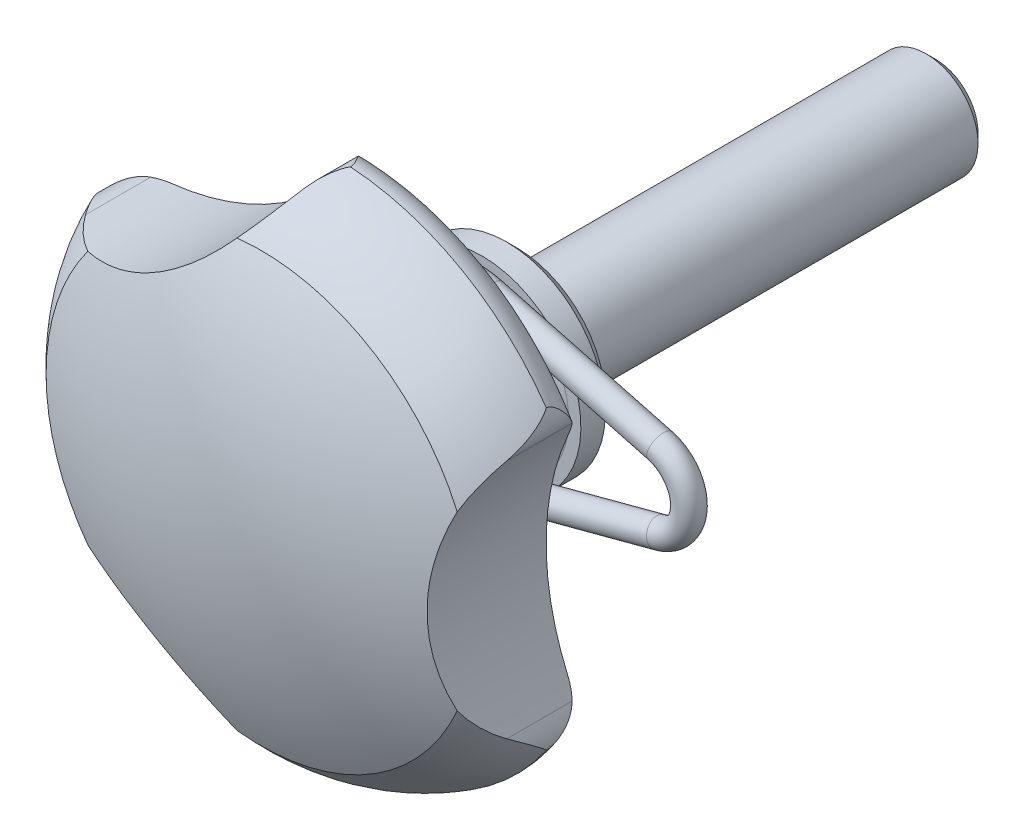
ISO-10303-21;
HEADER;
FILE_DESCRIPTION(('STEP AP214'),'2;1');
FILE_NAME('part.step','',(''),(''),'','','');
FILE_SCHEMA(('AUTOMOTIVE_DESIGN { 1 0 10303 214 1 1 1 1 }'));
ENDSEC;
DATA;
#1=APPLICATION_CONTEXT('core data for automotive mechanical design processes');
#2=APPLICATION_PROTOCOL_DEFINITION('international standard','automotive_design',2000,#1);
#3=PRODUCT_CONTEXT('',#1,'mechanical');
#4=PRODUCT('Part','Part','',(#3));
#5=PRODUCT_RELATED_PRODUCT_CATEGORY('part','',(#4));
#6=PRODUCT_DEFINITION_FORMATION('','',#4);
#7=PRODUCT_DEFINITION_CONTEXT('part definition',#1,'design');
#8=PRODUCT_DEFINITION('design','',#6,#7);
#9=PRODUCT_DEFINITION_SHAPE('','',#8);
#10=(LENGTH_UNIT() NAMED_UNIT(*) SI_UNIT(.MILLI.,.METRE.));
#11=(NAMED_UNIT(*) PLANE_ANGLE_UNIT() SI_UNIT($,.RADIAN.));
#12=(NAMED_UNIT(*) SI_UNIT($,.STERADIAN.) SOLID_ANGLE_UNIT());
#13=UNCERTAINTY_MEASURE_WITH_UNIT(LENGTH_MEASURE(1.E-05),#10,'distance_accuracy_value','');
#14=(GEOMETRIC_REPRESENTATION_CONTEXT(3) GLOBAL_UNCERTAINTY_ASSIGNED_CONTEXT((#13)) GLOBAL_UNIT_ASSIGNED_CONTEXT((#10,
#11,#12)) REPRESENTATION_CONTEXT('',''));
#15=CARTESIAN_POINT('',(0.,0.,0.));
#16=DIRECTION('',(0.,0.,1.));
#17=DIRECTION('',(1.,0.,0.));
#18=AXIS2_PLACEMENT_3D('',#15,#16,#17);
#19=CARTESIAN_POINT('',(0.,0.,5.));
#20=DIRECTION('',(0.,0.,1.));
#21=DIRECTION('',(0.,1.,0.));
#22=AXIS2_PLACEMENT_3D('',#19,#20,#21);
#23=TOROIDAL_SURFACE('',#22,8.51303191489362,1.36303191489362);
#24=CARTESIAN_POINT('',(0.,0.,6.35));
#25=DIRECTION('',(0.,0.,1.));
#26=DIRECTION('',(0.,1.,0.));
#27=AXIS2_PLACEMENT_3D('',#24,#25,#26);
#28=CIRCLE('',#27,8.325);
#29=CARTESIAN_POINT('',(0.,8.325,6.35));
#30=VERTEX_POINT('',#29);
#31=EDGE_CURVE('E672',#30,#30,#28,.T.);
#32=ORIENTED_EDGE('',*,*,#31,.F.);
#33=EDGE_LOOP('',(#32));
#34=FACE_BOUND('',#33,.T.);
#35=CARTESIAN_POINT('',(0.,0.,3.82626201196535));
#36=DIRECTION('',(0.,0.,-1.));
#37=DIRECTION('',(0.,-1.,0.));
#38=AXIS2_PLACEMENT_3D('',#35,#36,#37);
#39=CIRCLE('',#38,7.82007077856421);
#40=CARTESIAN_POINT('',(2.01086259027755,-7.55711179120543,3.82626201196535));
#41=VERTEX_POINT('',#40);
#42=CARTESIAN_POINT('',(2.01086259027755,7.55711179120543,3.82626201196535));
#43=VERTEX_POINT('',#42);
#44=EDGE_CURVE('E413',#41,#43,#39,.T.);
#45=ORIENTED_EDGE('',*,*,#44,.T.);
#46=CARTESIAN_POINT('',(1.79978858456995,7.6050382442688,6.17079126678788));
#47=CARTESIAN_POINT('',(1.87132667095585,7.59149186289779,6.17272963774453));
#48=CARTESIAN_POINT('',(1.94241225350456,7.57534963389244,6.17373412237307));
#49=CARTESIAN_POINT('',(2.08361370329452,7.53772800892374,6.17374137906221));
#50=CARTESIAN_POINT('',(2.1537211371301,7.51621701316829,6.17273204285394));
#51=CARTESIAN_POINT('',(2.29422836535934,7.4671052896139,6.16848446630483));
#52=CARTESIAN_POINT('',(2.36456641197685,7.43933249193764,6.16517628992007));
#53=CARTESIAN_POINT('',(2.50203009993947,7.37744319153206,6.15538425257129));
#54=CARTESIAN_POINT('',(2.56916408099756,7.34334443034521,6.14890919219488));
#55=CARTESIAN_POINT('',(2.6808382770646,7.27785870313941,6.13334871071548));
#56=CARTESIAN_POINT('',(2.72656691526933,7.24824577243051,6.12544804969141));
#57=CARTESIAN_POINT('',(2.81377071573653,7.18469949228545,6.10574552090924));
#58=CARTESIAN_POINT('',(2.85526523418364,7.15078755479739,6.09396255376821));
#59=CARTESIAN_POINT('',(2.932969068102,7.07800456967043,6.06455276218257));
#60=CARTESIAN_POINT('',(2.96907074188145,7.03905576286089,6.04682531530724));
#61=CARTESIAN_POINT('',(3.03278716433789,6.95844438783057,6.00390847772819));
#62=CARTESIAN_POINT('',(3.06042032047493,6.91678794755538,5.97873550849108));
#63=CARTESIAN_POINT('',(3.10308029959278,6.84040764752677,5.92493884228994));
#64=CARTESIAN_POINT('',(3.11938941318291,6.80559878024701,5.89743341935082));
#65=CARTESIAN_POINT('',(3.14643483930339,6.73833900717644,5.83719961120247));
#66=CARTESIAN_POINT('',(3.15715911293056,6.70589332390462,5.80446014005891));
#67=CARTESIAN_POINT('',(3.17635082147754,6.63794440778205,5.72671690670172));
#68=CARTESIAN_POINT('',(3.18376051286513,6.60340727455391,5.68061359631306));
#69=CARTESIAN_POINT('',(3.19472931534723,6.541536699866,5.58342505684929));
#70=CARTESIAN_POINT('',(3.19828598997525,6.51420782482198,5.5323366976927));
#71=CARTESIAN_POINT('',(3.20334911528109,6.46712692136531,5.4259287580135));
#72=CARTESIAN_POINT('',(3.20482917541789,6.44747467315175,5.37056398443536));
#73=CARTESIAN_POINT('',(3.2067932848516,6.41659026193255,5.25753712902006));
#74=CARTESIAN_POINT('',(3.20727736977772,6.40535779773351,5.19987512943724));
#75=CARTESIAN_POINT('',(3.20787839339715,6.39062655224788,5.07642770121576));
#76=CARTESIAN_POINT('',(3.20794350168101,6.38823486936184,5.01050742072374));
#77=CARTESIAN_POINT('',(3.20772512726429,6.39429674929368,4.87913366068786));
#78=CARTESIAN_POINT('',(3.20744143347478,6.40275687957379,4.81368048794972));
#79=CARTESIAN_POINT('',(3.20596728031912,6.43067595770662,4.68370261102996));
#80=CARTESIAN_POINT('',(3.20475766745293,6.4503649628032,4.61922724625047));
#81=CARTESIAN_POINT('',(3.19997017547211,6.5005030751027,4.49468200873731));
#82=CARTESIAN_POINT('',(3.1963937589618,6.53094553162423,4.43460944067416));
#83=CARTESIAN_POINT('',(3.1855950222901,6.59382025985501,4.33355651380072));
#84=CARTESIAN_POINT('',(3.17934712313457,6.62434364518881,4.29128229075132));
#85=CARTESIAN_POINT('',(3.16202710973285,6.69034974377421,4.21192295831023));
#86=CARTESIAN_POINT('',(3.15096204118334,6.72582516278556,4.17483037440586));
#87=CARTESIAN_POINT('',(3.12189383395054,6.80035573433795,4.10661172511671));
#88=CARTESIAN_POINT('',(3.10382392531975,6.83944249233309,4.07554753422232));
#89=CARTESIAN_POINT('',(3.05952168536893,6.91800331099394,4.02061890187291));
#90=CARTESIAN_POINT('',(3.03329881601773,6.95747687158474,3.99674617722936));
#91=CARTESIAN_POINT('',(2.97778974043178,7.02827703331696,3.958802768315));
#92=CARTESIAN_POINT('',(2.94954410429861,7.05994052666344,3.94380109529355));
#93=CARTESIAN_POINT('',(2.88866506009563,7.12058153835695,3.91778989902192));
#94=CARTESIAN_POINT('',(2.85602673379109,7.14955598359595,3.90678490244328));
#95=CARTESIAN_POINT('',(2.79129515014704,7.20149400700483,3.88887585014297));
#96=CARTESIAN_POINT('',(2.75953187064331,7.2247684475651,3.88165512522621));
#97=CARTESIAN_POINT('',(2.69409327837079,7.26903732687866,3.86906650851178));
#98=CARTESIAN_POINT('',(2.66041648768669,7.29002996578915,3.86370007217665));
#99=CARTESIAN_POINT('',(2.55689845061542,7.3500650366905,3.84963819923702));
#100=CARTESIAN_POINT('',(2.48490792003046,7.38590549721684,3.84306022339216));
#101=CARTESIAN_POINT('',(2.36197329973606,7.43977381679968,3.83495861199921));
#102=CARTESIAN_POINT('',(2.31190717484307,7.45978043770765,3.83248383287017));
#103=CARTESIAN_POINT('',(2.21061999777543,7.49685035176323,3.8287882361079));
#104=CARTESIAN_POINT('',(2.15939851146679,7.51391251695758,3.82756789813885));
#105=CARTESIAN_POINT('',(2.05711827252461,7.5448978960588,3.82622671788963));
#106=CARTESIAN_POINT('',(2.00607653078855,7.55887677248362,3.82608449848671));
#107=CARTESIAN_POINT('',(1.90337083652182,7.58405145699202,3.8268544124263));
#108=CARTESIAN_POINT('',(1.85170752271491,7.59524990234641,3.82776554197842));
#109=CARTESIAN_POINT('',(1.7997885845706,7.60503824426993,3.82920873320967));
#110=B_SPLINE_CURVE_WITH_KNOTS('',3,(#46,#47,#48,#49,#50,#51,#52,#53,#54,#55,#56,#57,#58,#59,
#60,#61,#62,#63,#64,#65,#66,#67,#68,#69,#70,#71,#72,#73,#74,#75,#76,#77,#78,#79,#80,#81,#82,#83,
#84,#85,#86,#87,#88,#89,#90,#91,#92,#93,#94,#95,#96,#97,#98,#99,#100,#101,#102,#103,#104,#105,
#106,#107,#108,#109),.UNSPECIFIED.,.F.,.F.,(4,2,2,2,2,2,2,2,2,2,2,2,2,2,2,2,2,2,2,2,2,2,2,2,2,2,
2,2,2,2,2,4),(0.,0.218470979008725,0.438259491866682,0.665045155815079,0.89120414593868,
1.05600690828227,1.22001891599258,1.38696047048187,1.55353653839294,1.69461095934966,
1.83598824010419,2.00931569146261,2.18275268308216,2.35837441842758,2.53398987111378,
2.73097011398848,2.92806962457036,3.12936032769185,3.33052675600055,3.48746649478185,
3.64417745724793,3.80242044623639,3.960480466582,4.09496109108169,4.22959355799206,
4.34951804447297,4.46953644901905,4.71086046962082,4.87269806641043,5.03459752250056,
5.19327819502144,5.35180777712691),.UNSPECIFIED.);
#111=CARTESIAN_POINT('',(2.01086259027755,7.55711179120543,6.17373798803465));
#112=VERTEX_POINT('',#111);
#113=EDGE_CURVE('E221',#112,#43,#110,.T.);
#114=ORIENTED_EDGE('',*,*,#113,.F.);
#115=CARTESIAN_POINT('',(0.,0.,6.17373798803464));
#116=DIRECTION('',(0.,0.,1.));
#117=DIRECTION('',(0.,1.,0.));
#118=AXIS2_PLACEMENT_3D('',#115,#116,#117);
#119=CIRCLE('',#118,7.82007077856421);
#120=CARTESIAN_POINT('',(2.01086259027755,-7.55711179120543,6.17373798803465));
#121=VERTEX_POINT('',#120);
#122=EDGE_CURVE('E25',#112,#121,#119,.T.);
#123=ORIENTED_EDGE('',*,*,#122,.T.);
#124=CARTESIAN_POINT('',(1.79978858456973,-7.60503824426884,3.82920873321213));
#125=CARTESIAN_POINT('',(1.87132667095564,-7.59149186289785,3.82727036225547));
#126=CARTESIAN_POINT('',(1.94241225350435,-7.57534963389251,3.82626587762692));
#127=CARTESIAN_POINT('',(2.08361370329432,-7.53772800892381,3.82625862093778));
#128=CARTESIAN_POINT('',(2.15372113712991,-7.51621701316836,3.82726795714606));
#129=CARTESIAN_POINT('',(2.29422836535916,-7.46710528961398,3.83151553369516));
#130=CARTESIAN_POINT('',(2.36456641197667,-7.43933249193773,3.83482371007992));
#131=CARTESIAN_POINT('',(2.5020300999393,-7.37744319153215,3.84461574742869));
#132=CARTESIAN_POINT('',(2.5691640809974,-7.3433444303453,3.8510908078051));
#133=CARTESIAN_POINT('',(2.68083827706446,-7.2778587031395,3.86665128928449));
#134=CARTESIAN_POINT('',(2.7265669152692,-7.24824577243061,3.87455195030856));
#135=CARTESIAN_POINT('',(2.81377071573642,-7.18469949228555,3.89425447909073));
#136=CARTESIAN_POINT('',(2.85526523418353,-7.15078755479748,3.90603744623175));
#137=CARTESIAN_POINT('',(2.93296906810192,-7.07800456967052,3.93544723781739));
#138=CARTESIAN_POINT('',(2.96907074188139,-7.03905576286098,3.95317468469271));
#139=CARTESIAN_POINT('',(3.03278716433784,-6.95844438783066,3.99609152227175));
#140=CARTESIAN_POINT('',(3.06042032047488,-6.91678794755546,4.02126449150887));
#141=CARTESIAN_POINT('',(3.10308029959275,-6.84040764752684,4.07506115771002));
#142=CARTESIAN_POINT('',(3.1193894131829,-6.80559878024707,4.10256658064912));
#143=CARTESIAN_POINT('',(3.14643483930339,-6.73833900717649,4.16280038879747));
#144=CARTESIAN_POINT('',(3.15715911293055,-6.70589332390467,4.19553985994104));
#145=CARTESIAN_POINT('',(3.17635082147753,-6.63794440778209,4.27328309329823));
#146=CARTESIAN_POINT('',(3.18376051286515,-6.60340727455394,4.31938640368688));
#147=CARTESIAN_POINT('',(3.19472931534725,-6.54153669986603,4.41657494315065));
#148=CARTESIAN_POINT('',(3.19828598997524,-6.51420782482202,4.46766330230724));
#149=CARTESIAN_POINT('',(3.20334911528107,-6.46712692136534,4.57407124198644));
#150=CARTESIAN_POINT('',(3.2048291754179,-6.44747467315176,4.62943601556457));
#151=CARTESIAN_POINT('',(3.20679328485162,-6.41659026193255,4.74246287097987));
#152=CARTESIAN_POINT('',(3.20727736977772,-6.40535779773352,4.80012487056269));
#153=CARTESIAN_POINT('',(3.20787839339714,-6.39062655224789,4.92357229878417));
#154=CARTESIAN_POINT('',(3.20794350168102,-6.38823486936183,4.98949257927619));
#155=CARTESIAN_POINT('',(3.20772512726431,-6.39429674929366,5.12086633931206));
#156=CARTESIAN_POINT('',(3.20744143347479,-6.40275687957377,5.1863195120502));
#157=CARTESIAN_POINT('',(3.20596728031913,-6.43067595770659,5.31629738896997));
#158=CARTESIAN_POINT('',(3.20475766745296,-6.45036496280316,5.38077275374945));
#159=CARTESIAN_POINT('',(3.19997017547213,-6.50050307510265,5.50531799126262));
#160=CARTESIAN_POINT('',(3.19639375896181,-6.53094553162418,5.56539055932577));
#161=CARTESIAN_POINT('',(3.18559502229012,-6.59382025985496,5.66644348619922));
#162=CARTESIAN_POINT('',(3.1793471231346,-6.62434364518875,5.70871770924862));
#163=CARTESIAN_POINT('',(3.16202710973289,-6.69034974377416,5.78807704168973));
#164=CARTESIAN_POINT('',(3.15096204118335,-6.72582516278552,5.82516962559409));
#165=CARTESIAN_POINT('',(3.12189383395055,-6.80035573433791,5.89338827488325));
#166=CARTESIAN_POINT('',(3.10382392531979,-6.83944249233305,5.92445246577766));
#167=CARTESIAN_POINT('',(3.05952168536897,-6.9180033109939,5.97938109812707));
#168=CARTESIAN_POINT('',(3.03329881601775,-6.9574768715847,6.00325382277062));
#169=CARTESIAN_POINT('',(2.9777897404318,-7.02827703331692,6.04119723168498));
#170=CARTESIAN_POINT('',(2.94954410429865,-7.05994052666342,6.05619890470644));
#171=CARTESIAN_POINT('',(2.88866506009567,-7.12058153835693,6.08221010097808));
#172=CARTESIAN_POINT('',(2.85602673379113,-7.14955598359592,6.09321509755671));
#173=CARTESIAN_POINT('',(2.79129515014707,-7.2014940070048,6.11112414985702));
#174=CARTESIAN_POINT('',(2.75953187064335,-7.22476844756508,6.11834487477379));
#175=CARTESIAN_POINT('',(2.69409327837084,-7.26903732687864,6.13093349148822));
#176=CARTESIAN_POINT('',(2.66041648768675,-7.29002996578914,6.13629992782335));
#177=CARTESIAN_POINT('',(2.55689845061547,-7.35006503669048,6.15036180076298));
#178=CARTESIAN_POINT('',(2.48490792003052,-7.38590549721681,6.15693977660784));
#179=CARTESIAN_POINT('',(2.3619732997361,-7.43977381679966,6.16504138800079));
#180=CARTESIAN_POINT('',(2.31190717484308,-7.45978043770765,6.16751616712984));
#181=CARTESIAN_POINT('',(2.2106199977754,-7.49685035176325,6.17121176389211));
#182=CARTESIAN_POINT('',(2.15939851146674,-7.51391251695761,6.17243210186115));
#183=CARTESIAN_POINT('',(2.05711827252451,-7.54489789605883,6.17377328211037));
#184=CARTESIAN_POINT('',(2.00607653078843,-7.55887677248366,6.17391550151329));
#185=CARTESIAN_POINT('',(1.90337083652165,-7.58405145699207,6.1731455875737));
#186=CARTESIAN_POINT('',(1.85170752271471,-7.59524990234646,6.17223445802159));
#187=CARTESIAN_POINT('',(1.79978858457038,-7.60503824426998,6.17079126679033));
#188=B_SPLINE_CURVE_WITH_KNOTS('',3,(#124,#125,#126,#127,#128,#129,#130,#131,#132,#133,#134,
#135,#136,#137,#138,#139,#140,#141,#142,#143,#144,#145,#146,#147,#148,#149,#150,#151,#152,#153,
#154,#155,#156,#157,#158,#159,#160,#161,#162,#163,#164,#165,#166,#167,#168,#169,#170,#171,#172,
#173,#174,#175,#176,#177,#178,#179,#180,#181,#182,#183,#184,#185,#186,#187),.UNSPECIFIED.,.F.,
.F.,(4,2,2,2,2,2,2,2,2,2,2,2,2,2,2,2,2,2,2,2,2,2,2,2,2,2,2,2,2,2,2,4),(0.,0.21847097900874,
0.438259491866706,0.665045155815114,0.89120414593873,1.05600690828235,1.22001891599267,
1.38696047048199,1.55353653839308,1.69461095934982,1.83598824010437,2.00931569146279,
2.18275268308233,2.35837441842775,2.53398987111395,2.73097011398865,2.92806962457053,
3.12936032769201,3.33052675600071,3.48746649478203,3.64417745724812,3.80242044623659,
3.96048046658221,4.0949610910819,4.22959355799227,4.34951804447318,4.46953644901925,
4.71086046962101,4.8726980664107,5.0345975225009,5.19327819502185,5.35180777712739),.UNSPECIFIED.);
#189=EDGE_CURVE('E197',#41,#121,#188,.T.);
#190=ORIENTED_EDGE('',*,*,#189,.F.);
#191=EDGE_LOOP('',(#45,#114,#123,#190));
#192=FACE_BOUND('',#191,.T.);
#193=CARTESIAN_POINT('',(0.,0.,3.65));
#194=DIRECTION('',(0.,0.,1.));
#195=DIRECTION('',(0.,1.,0.));
#196=AXIS2_PLACEMENT_3D('',#193,#194,#195);
#197=CIRCLE('',#196,8.325);
#198=CARTESIAN_POINT('',(0.,8.325,3.65));
#199=VERTEX_POINT('',#198);
#200=EDGE_CURVE('E669',#199,#199,#197,.T.);
#201=ORIENTED_EDGE('',*,*,#200,.T.);
#202=EDGE_LOOP('',(#201));
#203=FACE_BOUND('',#202,.T.);
#204=ADVANCED_FACE('F14',(#34,#192,#203),#23,.F.);
#205=CARTESIAN_POINT('',(0.,0.,18.));
#206=DIRECTION('',(0.,0.,1.));
#207=DIRECTION('',(0.,1.,0.));
#208=AXIS2_PLACEMENT_3D('',#205,#206,#207);
#209=TOROIDAL_SURFACE('',#208,22.,3.);
#210=CARTESIAN_POINT('',(0.,0.,15.));
#211=DIRECTION('',(0.,0.,1.));
#212=DIRECTION('',(0.,1.,0.));
#213=AXIS2_PLACEMENT_3D('',#210,#211,#212);
#214=CIRCLE('',#213,22.);
#215=CARTESIAN_POINT('',(19.5911764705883,10.009285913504,15.));
#216=VERTEX_POINT('',#215);
#217=CARTESIAN_POINT('',(-1.12729236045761,21.9710994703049,14.9999999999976));
#218=VERTEX_POINT('',#217);
#219=EDGE_CURVE('E580',#216,#218,#214,.T.);
#220=ORIENTED_EDGE('',*,*,#219,.T.);
#221=CARTESIAN_POINT('',(-4.18910416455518,18.5324420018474,18.0002));
#222=CARTESIAN_POINT('',(-4.18912689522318,18.5324223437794,17.9531521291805));
#223=CARTESIAN_POINT('',(-4.18751024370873,18.5339301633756,17.9061178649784));
#224=CARTESIAN_POINT('',(-4.18113949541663,18.5398804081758,17.812510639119));
#225=CARTESIAN_POINT('',(-4.17638961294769,18.5443188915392,17.7659371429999));
#226=CARTESIAN_POINT('',(-4.16397265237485,18.5559362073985,17.6741457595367));
#227=CARTESIAN_POINT('',(-4.15634351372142,18.5630794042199,17.6289181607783));
#228=CARTESIAN_POINT('',(-4.13839726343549,18.5799115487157,17.5394782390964));
#229=CARTESIAN_POINT('',(-4.12807910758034,18.5896014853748,17.4952663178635));
#230=CARTESIAN_POINT('',(-4.08670645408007,18.6285377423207,17.3389002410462));
#231=CARTESIAN_POINT('',(-4.04871217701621,18.664432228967,17.2301628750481));
#232=CARTESIAN_POINT('',(-3.96100131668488,18.748001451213,17.0219477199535));
#233=CARTESIAN_POINT('',(-3.91121549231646,18.7957458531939,16.92252966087));
#234=CARTESIAN_POINT('',(-3.81275965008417,18.8910986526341,16.7489826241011));
#235=CARTESIAN_POINT('',(-3.76530518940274,18.9373845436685,16.6734099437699));
#236=CARTESIAN_POINT('',(-3.66634035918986,19.0347619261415,16.5282061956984));
#237=CARTESIAN_POINT('',(-3.61482727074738,19.0858566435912,16.4585791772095));
#238=CARTESIAN_POINT('',(-3.50877674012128,19.1920330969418,16.32476704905));
#239=CARTESIAN_POINT('',(-3.45423618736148,19.2471189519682,16.2605877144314));
#240=CARTESIAN_POINT('',(-3.34291527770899,19.3606605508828,16.1373400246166));
#241=CARTESIAN_POINT('',(-3.2861342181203,19.4191173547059,16.0782732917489));
#242=CARTESIAN_POINT('',(-3.13582303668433,19.5754544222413,15.9304681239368));
#243=CARTESIAN_POINT('',(-3.04095737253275,19.6756771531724,15.8455475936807));
#244=CARTESIAN_POINT('',(-2.84848861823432,19.8825934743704,15.6874401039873));
#245=CARTESIAN_POINT('',(-2.75088405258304,19.9892905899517,15.6142596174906));
#246=CARTESIAN_POINT('',(-2.55396483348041,20.2084895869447,15.4794179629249));
#247=CARTESIAN_POINT('',(-2.45464845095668,20.3209975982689,15.4177692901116));
#248=CARTESIAN_POINT('',(-2.25530271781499,20.5510913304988,15.3063317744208));
#249=CARTESIAN_POINT('',(-2.15527352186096,20.668675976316,15.2565404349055));
#250=CARTESIAN_POINT('',(-1.95335182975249,20.9106507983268,15.168540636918));
#251=CARTESIAN_POINT('',(-1.8514596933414,21.0351274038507,15.1305677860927));
#252=CARTESIAN_POINT('',(-1.64845848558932,21.288158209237,15.0683792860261));
#253=CARTESIAN_POINT('',(-1.54734957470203,21.4167132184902,15.0441663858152));
#254=CARTESIAN_POINT('',(-1.34695254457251,21.6767846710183,15.0106804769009));
#255=CARTESIAN_POINT('',(-1.24766115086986,21.8082945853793,15.0013772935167));
#256=CARTESIAN_POINT('',(-1.05169678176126,22.0732680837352,14.9989053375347));
#257=CARTESIAN_POINT('',(-0.955022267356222,22.2067304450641,15.0057268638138));
#258=CARTESIAN_POINT('',(-0.734867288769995,22.5170661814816,15.0419097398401));
#259=CARTESIAN_POINT('',(-0.612671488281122,22.694208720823,15.0777661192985));
#260=CARTESIAN_POINT('',(-0.436454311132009,22.9566210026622,15.1565532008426));
#261=CARTESIAN_POINT('',(-0.378947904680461,23.0434575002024,15.1869404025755));
#262=CARTESIAN_POINT('',(-0.26659256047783,23.2153799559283,15.2563262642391));
#263=CARTESIAN_POINT('',(-0.211742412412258,23.3004667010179,15.2953209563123));
#264=CARTESIAN_POINT('',(-0.111337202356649,23.4582473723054,15.3770660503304));
#265=CARTESIAN_POINT('',(-0.0654443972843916,23.5312287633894,15.4188471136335));
#266=CARTESIAN_POINT('',(0.0236907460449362,23.6745427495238,15.5093769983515));
#267=CARTESIAN_POINT('',(0.0669307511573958,23.7448729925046,15.558131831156));
#268=CARTESIAN_POINT('',(0.108677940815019,23.8135096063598,15.6103800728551));
#269=B_SPLINE_CURVE_WITH_KNOTS('',3,(#221,#222,#223,#224,#225,#226,#227,#228,#229,#230,#231,
#232,#233,#234,#235,#236,#237,#238,#239,#240,#241,#242,#243,#244,#245,#246,#247,#248,#249,#250,
#251,#252,#253,#254,#255,#256,#257,#258,#259,#260,#261,#262,#263,#264,#265,#266,#267,#268),
.UNSPECIFIED.,.F.,.F.,(4,2,2,2,2,2,2,2,2,2,2,2,2,2,2,2,2,2,2,2,2,2,2,4),(0.,0.141068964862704,
0.28194857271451,0.421033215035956,0.560171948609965,0.919912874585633,1.28182102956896,
1.58297830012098,1.88433906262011,2.18601540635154,2.48778712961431,2.97320384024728,
3.45888727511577,3.94509396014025,4.43119818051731,4.92645023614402,5.42180120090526,
5.91614838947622,6.41019823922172,7.061822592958,7.38699409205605,7.71201600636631,
7.99910829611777,8.28644956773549),.UNSPECIFIED.);
#270=CARTESIAN_POINT('',(0.108556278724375,23.8133096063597,15.6102278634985));
#271=VERTEX_POINT('',#270);
#272=EDGE_CURVE('E330',#218,#271,#269,.T.);
#273=ORIENTED_EDGE('',*,*,#272,.T.);
#274=CARTESIAN_POINT('',(1.66020053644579,24.9448137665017,18.0002));
#275=CARTESIAN_POINT('',(1.66026271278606,24.9448191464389,17.964656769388));
#276=CARTESIAN_POINT('',(1.65815320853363,24.9443218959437,17.9291682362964));
#277=CARTESIAN_POINT('',(1.65005918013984,24.9423600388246,17.8588144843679));
#278=CARTESIAN_POINT('',(1.64409182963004,24.940899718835,17.823947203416));
#279=CARTESIAN_POINT('',(1.62141224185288,24.9352099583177,17.7221134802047));
#280=CARTESIAN_POINT('',(1.59988115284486,24.9296678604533,17.6562996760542));
#281=CARTESIAN_POINT('',(1.55273506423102,24.9165473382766,17.5390744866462));
#282=CARTESIAN_POINT('',(1.52836170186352,24.9094494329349,17.4870665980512));
#283=CARTESIAN_POINT('',(1.47581939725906,24.8931142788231,17.3853310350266));
#284=CARTESIAN_POINT('',(1.44764777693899,24.8838755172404,17.3356050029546));
#285=CARTESIAN_POINT('',(1.35873418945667,24.852731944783,17.1878379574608));
#286=CARTESIAN_POINT('',(1.29430369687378,24.8275754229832,17.0927266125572));
#287=CARTESIAN_POINT('',(1.16216346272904,24.7688074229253,16.9081919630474));
#288=CARTESIAN_POINT('',(1.09446514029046,24.7352238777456,16.8187510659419));
#289=CARTESIAN_POINT('',(0.958372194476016,24.6593009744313,16.6440766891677));
#290=CARTESIAN_POINT('',(0.889977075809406,24.616954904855,16.5588464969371));
#291=CARTESIAN_POINT('',(0.755009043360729,24.5236019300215,16.3930512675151));
#292=CARTESIAN_POINT('',(0.688426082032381,24.4726651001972,16.3124550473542));
#293=CARTESIAN_POINT('',(0.558093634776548,24.3616402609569,16.1554852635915));
#294=CARTESIAN_POINT('',(0.494341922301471,24.3015596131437,16.0791083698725));
#295=CARTESIAN_POINT('',(0.373994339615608,24.1749962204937,15.9345666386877));
#296=CARTESIAN_POINT('',(0.317202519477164,24.1089518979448,15.8661841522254));
#297=CARTESIAN_POINT('',(0.208623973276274,23.9678265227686,15.7342222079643));
#298=CARTESIAN_POINT('',(0.156859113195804,23.8927089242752,15.6706639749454));
#299=CARTESIAN_POINT('',(0.108434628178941,23.8131096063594,15.6100756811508));
#300=B_SPLINE_CURVE_WITH_KNOTS('',3,(#274,#275,#276,#277,#278,#279,#280,#281,#282,#283,#284,
#285,#286,#287,#288,#289,#290,#291,#292,#293,#294,#295,#296,#297,#298,#299),.UNSPECIFIED.,.F.,
.F.,(4,2,2,2,2,2,2,2,2,2,2,2,4),(0.,0.106471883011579,0.212473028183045,0.419728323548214,
0.59312825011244,0.766651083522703,1.11870906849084,1.46961515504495,1.82079101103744,
2.16922978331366,2.51738950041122,2.84904713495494,3.18208821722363),.UNSPECIFIED.);
#301=CARTESIAN_POINT('',(1.66020055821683,24.9448137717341,18.));
#302=VERTEX_POINT('',#301);
#303=EDGE_CURVE('E369',#302,#271,#300,.T.);
#304=ORIENTED_EDGE('',*,*,#303,.F.);
#305=CARTESIAN_POINT('',(0.,0.,18.));
#306=DIRECTION('',(0.,0.,1.));
#307=DIRECTION('',(0.,1.,0.));
#308=AXIS2_PLACEMENT_3D('',#305,#306,#307);
#309=CIRCLE('',#308,25.);
#310=CARTESIAN_POINT('',(20.5226011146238,14.2766537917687,18.0000000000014));
#311=VERTEX_POINT('',#310);
#312=EDGE_CURVE('E553',#311,#302,#309,.T.);
#313=ORIENTED_EDGE('',*,*,#312,.F.);
#314=CARTESIAN_POINT('',(20.3463625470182,11.5851779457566,15.3538541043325));
#315=CARTESIAN_POINT('',(20.3913177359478,11.671126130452,15.3974520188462));
#316=CARTESIAN_POINT('',(20.4318446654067,11.7577410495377,15.4440874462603));
#317=CARTESIAN_POINT('',(20.5044144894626,11.9313674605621,15.5425676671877));
#318=CARTESIAN_POINT('',(20.5364710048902,12.0183780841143,15.5944039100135));
#319=CARTESIAN_POINT('',(20.5925223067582,12.1918549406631,15.7023874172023));
#320=CARTESIAN_POINT('',(20.616543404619,12.2783220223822,15.7585198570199));
#321=CARTESIAN_POINT('',(20.6571629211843,12.4504114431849,15.8746919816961));
#322=CARTESIAN_POINT('',(20.6737577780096,12.536033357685,15.9347335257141));
#323=CARTESIAN_POINT('',(20.703048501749,12.7255462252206,16.0726045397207));
#324=CARTESIAN_POINT('',(20.7139457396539,12.8290654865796,16.1513283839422));
#325=CARTESIAN_POINT('',(20.7261437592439,13.0329273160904,16.3135287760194));
#326=CARTESIAN_POINT('',(20.7274408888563,13.1332686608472,16.397007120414));
#327=CARTESIAN_POINT('',(20.7214706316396,13.3295694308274,16.5686172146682));
#328=CARTESIAN_POINT('',(20.7142049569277,13.4255297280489,16.6567480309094));
#329=CARTESIAN_POINT('',(20.692377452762,13.6114497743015,16.8381845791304));
#330=CARTESIAN_POINT('',(20.6778219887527,13.7014146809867,16.9314857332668));
#331=CARTESIAN_POINT('',(20.6491188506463,13.8442758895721,17.0933853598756));
#332=CARTESIAN_POINT('',(20.6364027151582,13.8996534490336,17.1600511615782));
#333=CARTESIAN_POINT('',(20.6097142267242,14.0045009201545,17.2978180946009));
#334=CARTESIAN_POINT('',(20.5957415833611,14.0539694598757,17.3689202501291));
#335=CARTESIAN_POINT('',(20.5729520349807,14.129046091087,17.4939982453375));
#336=CARTESIAN_POINT('',(20.5638947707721,14.1572671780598,17.546334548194));
#337=CARTESIAN_POINT('',(20.5474921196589,14.2065844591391,17.6543049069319));
#338=CARTESIAN_POINT('',(20.5401364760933,14.2277237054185,17.7099165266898));
#339=CARTESIAN_POINT('',(20.5307638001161,14.2541808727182,17.8047610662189));
#340=CARTESIAN_POINT('',(20.5277808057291,14.2624394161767,17.84305386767));
#341=CARTESIAN_POINT('',(20.5236625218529,14.2737584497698,17.9209139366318));
#342=CARTESIAN_POINT('',(20.5225481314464,14.2767601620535,17.9604906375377));
#343=CARTESIAN_POINT('',(20.5226011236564,14.276653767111,18.0002));
#344=B_SPLINE_CURVE_WITH_KNOTS('',3,(#314,#315,#316,#317,#318,#319,#320,#321,#322,#323,#324,
#325,#326,#327,#328,#329,#330,#331,#332,#333,#334,#335,#336,#337,#338,#339,#340,#341,#342,#343),
.UNSPECIFIED.,.F.,.F.,(4,2,2,2,2,2,2,2,2,2,2,2,2,2,4),(0.,0.318764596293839,0.637013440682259,
0.954209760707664,1.27155805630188,1.66255473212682,2.05370014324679,2.4447673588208,
2.83549368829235,3.09808919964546,3.3607455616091,3.54086286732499,3.71986443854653,
3.83734239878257,3.95612571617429),.UNSPECIFIED.);
#345=CARTESIAN_POINT('',(20.346467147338,11.5853779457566,15.353955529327));
#346=VERTEX_POINT('',#345);
#347=EDGE_CURVE('E361',#346,#311,#344,.T.);
#348=ORIENTED_EDGE('',*,*,#347,.F.);
#349=CARTESIAN_POINT('',(20.3465717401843,11.5855779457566,15.3540569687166));
#350=CARTESIAN_POINT('',(20.2920306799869,11.481316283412,15.3011546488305));
#351=CARTESIAN_POINT('',(20.2369860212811,11.3742416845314,15.2545689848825));
#352=CARTESIAN_POINT('',(20.126774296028,11.1558738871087,15.1736172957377));
#353=CARTESIAN_POINT('',(20.071607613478,11.0445884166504,15.139229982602));
#354=CARTESIAN_POINT('',(19.9623713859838,10.8199252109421,15.082355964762));
#355=CARTESIAN_POINT('',(19.9082963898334,10.7065781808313,15.0597572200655));
#356=CARTESIAN_POINT('',(19.8012538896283,10.4777359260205,15.0253381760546));
#357=CARTESIAN_POINT('',(19.748286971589,10.3622396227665,15.0135234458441));
#358=CARTESIAN_POINT('',(19.5761333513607,9.97905226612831,14.9913202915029));
#359=CARTESIAN_POINT('',(19.4601991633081,9.70833254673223,15.0026738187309));
#360=CARTESIAN_POINT('',(19.2950181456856,9.30325418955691,15.0544204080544));
#361=CARTESIAN_POINT('',(19.2412821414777,9.16804256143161,15.0775617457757));
#362=CARTESIAN_POINT('',(19.1369217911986,8.89872614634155,15.1347295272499));
#363=CARTESIAN_POINT('',(19.0862961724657,8.76462092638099,15.1687514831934));
#364=CARTESIAN_POINT('',(18.9874144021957,8.495835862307,15.2477642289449));
#365=CARTESIAN_POINT('',(18.9392179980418,8.36118983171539,15.2929430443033));
#366=CARTESIAN_POINT('',(18.8462716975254,8.09450877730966,15.3934790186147));
#367=CARTESIAN_POINT('',(18.8015223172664,7.96247414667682,15.4488376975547));
#368=CARTESIAN_POINT('',(18.7156186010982,7.7020747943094,15.5693993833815));
#369=CARTESIAN_POINT('',(18.6744579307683,7.57370388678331,15.6345844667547));
#370=CARTESIAN_POINT('',(18.59573689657,7.32145298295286,15.7748995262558));
#371=CARTESIAN_POINT('',(18.5581750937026,7.19757120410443,15.8500254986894));
#372=CARTESIAN_POINT('',(18.4786738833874,6.9281824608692,16.0288226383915));
#373=CARTESIAN_POINT('',(18.4376572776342,6.78409823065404,16.135110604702));
#374=CARTESIAN_POINT('',(18.3806925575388,6.57754878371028,16.307439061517));
#375=CARTESIAN_POINT('',(18.3624641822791,6.5102944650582,16.3670319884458));
#376=CARTESIAN_POINT('',(18.3276380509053,6.37977061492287,16.4908630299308));
#377=CARTESIAN_POINT('',(18.3110398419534,6.31649997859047,16.5550998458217));
#378=CARTESIAN_POINT('',(18.2727620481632,6.16839053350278,16.7177667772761));
#379=CARTESIAN_POINT('',(18.2520277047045,6.08619506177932,16.8188812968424));
#380=CARTESIAN_POINT('',(18.2150282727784,5.93683885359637,17.0324932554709));
#381=CARTESIAN_POINT('',(18.1987549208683,5.86965036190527,17.1449691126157));
#382=CARTESIAN_POINT('',(18.1756364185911,5.77296213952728,17.3480480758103));
#383=CARTESIAN_POINT('',(18.1674271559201,5.73817712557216,17.435951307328));
#384=CARTESIAN_POINT('',(18.1545118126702,5.6831351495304,17.616362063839));
#385=CARTESIAN_POINT('',(18.1497950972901,5.66283409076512,17.7088546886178));
#386=CARTESIAN_POINT('',(18.1460626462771,5.64674658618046,17.8351536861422));
#387=CARTESIAN_POINT('',(18.1453338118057,5.64360164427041,17.8680674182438));
#388=CARTESIAN_POINT('',(18.1443607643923,5.63940086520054,17.9340491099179));
#389=CARTESIAN_POINT('',(18.1441167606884,5.6383459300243,17.9671171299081));
#390=CARTESIAN_POINT('',(18.1441176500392,5.63835037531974,18.0002));
#391=B_SPLINE_CURVE_WITH_KNOTS('',3,(#349,#350,#351,#352,#353,#354,#355,#356,#357,#358,#359,
#360,#361,#362,#363,#364,#365,#366,#367,#368,#369,#370,#371,#372,#373,#374,#375,#376,#377,#378,
#379,#380,#381,#382,#383,#384,#385,#386,#387,#388,#389,#390),.UNSPECIFIED.,.F.,.F.,(4,2,2,2,2,2,
2,2,2,2,2,2,2,2,2,2,2,2,2,2,4),(0.,0.38669585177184,0.772713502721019,1.15499229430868,
1.53746839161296,2.41622089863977,2.85791414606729,3.29942544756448,3.74895692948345,
4.19855558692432,4.64734387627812,5.09595196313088,5.64571847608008,5.92060747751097,
6.19541990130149,6.59021037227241,6.98426452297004,7.26792470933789,7.55071755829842,
7.64987637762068,7.74907798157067),.UNSPECIFIED.);
#392=EDGE_CURVE('E322',#346,#216,#391,.T.);
#393=ORIENTED_EDGE('',*,*,#392,.T.);
#394=EDGE_LOOP('',(#220,#273,#304,#313,#348,#393));
#395=FACE_BOUND('',#394,.T.);
#396=ADVANCED_FACE('F214',(#395),#209,.T.);
#397=CARTESIAN_POINT('',(-0.140128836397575,-23.4130463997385,15.3538490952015));
#398=CARTESIAN_POINT('',(-0.0881734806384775,-23.4949528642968,15.3974466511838));
#399=CARTESIAN_POINT('',(-0.0334265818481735,-23.5733577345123,15.4440817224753));
#400=CARTESIAN_POINT('',(0.0806526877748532,-23.7230184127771,15.5425612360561));
#401=CARTESIAN_POINT('',(0.139977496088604,-23.7942855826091,15.5943971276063));
#402=CARTESIAN_POINT('',(0.262186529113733,-23.9295660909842,15.7023799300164));
#403=CARTESIAN_POINT('',(0.325058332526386,-23.993602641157,15.7585120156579));
#404=CARTESIAN_POINT('',(0.453781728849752,-24.1148251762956,15.8746834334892));
#405=CARTESIAN_POINT('',(0.519634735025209,-24.1720078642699,15.9347246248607));
#406=CARTESIAN_POINT('',(0.669111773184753,-24.2921313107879,16.0725949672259));
#407=CARTESIAN_POINT('',(0.75331323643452,-24.3533285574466,16.1513185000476));
#408=CARTESIAN_POINT('',(0.92376334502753,-24.4658239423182,16.3135182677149));
#409=CARTESIAN_POINT('',(1.01001275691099,-24.5171183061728,16.396996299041));
#410=CARTESIAN_POINT('',(1.18299906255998,-24.6100990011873,16.5686057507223));
#411=CARTESIAN_POINT('',(1.26973585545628,-24.6517872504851,16.6567362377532));
#412=CARTESIAN_POINT('',(1.44166100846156,-24.7258448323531,16.8381720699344));
#413=CARTESIAN_POINT('',(1.52685065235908,-24.7582222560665,16.9314728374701));
#414=CARTESIAN_POINT('',(1.66492459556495,-24.8047960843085,17.0933725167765));
#415=CARTESIAN_POINT('',(1.71924185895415,-24.8214728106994,17.1600388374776));
#416=CARTESIAN_POINT('',(1.82338839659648,-24.850784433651,17.2978068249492));
#417=CARTESIAN_POINT('',(1.8732166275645,-24.8634183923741,17.3689095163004));
#418=CARTESIAN_POINT('',(1.94963119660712,-24.8812208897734,17.4939883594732));
#419=CARTESIAN_POINT('',(1.97860062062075,-24.8874877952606,17.5463249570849));
#420=CARTESIAN_POINT('',(2.02951324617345,-24.8979416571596,17.6542959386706));
#421=CARTESIAN_POINT('',(2.05149886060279,-24.902141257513,17.7099078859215));
#422=CARTESIAN_POINT('',(2.07909916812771,-24.9072531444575,17.8047540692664));
#423=CARTESIAN_POINT('',(2.08774337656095,-24.9087991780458,17.8430481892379));
#424=CARTESIAN_POINT('',(2.09960593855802,-24.9108923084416,17.9209110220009));
#425=CARTESIAN_POINT('',(2.10276293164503,-24.9114281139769,17.9604891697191));
#426=CARTESIAN_POINT('',(2.10264428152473,-24.911420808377,18.0002));
#427=B_SPLINE_CURVE_WITH_KNOTS('',3,(#397,#398,#399,#400,#401,#402,#403,#404,#405,#406,#407,
#408,#409,#410,#411,#412,#413,#414,#415,#416,#417,#418,#419,#420,#421,#422,#423,#424,#425,#426),
.UNSPECIFIED.,.F.,.F.,(4,2,2,2,2,2,2,2,2,2,2,2,2,2,4),(0.,0.318763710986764,0.637011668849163,
0.954207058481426,1.27155442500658,1.66255056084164,2.05369542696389,2.44476212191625,
2.83548794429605,3.09808642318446,3.36074577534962,3.54086480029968,3.7198680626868,
3.8373502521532,3.95613792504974),.UNSPECIFIED.);
#428=CARTESIAN_POINT('',(-0.1400019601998,-23.4132463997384,15.3539555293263));
#429=VERTEX_POINT('',#428);
#430=CARTESIAN_POINT('',(2.10264430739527,-24.9114208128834,18.0000000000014));
#431=VERTEX_POINT('',#430);
#432=EDGE_CURVE('E387',#429,#431,#427,.T.);
#433=ORIENTED_EDGE('',*,*,#432,.F.);
#434=CARTESIAN_POINT('',(-0.139875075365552,-23.4134463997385,15.3540619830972));
#435=CARTESIAN_POINT('',(-0.2028976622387,-23.3140817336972,15.3011592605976));
#436=CARTESIAN_POINT('',(-0.268104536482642,-23.2128744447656,15.2545732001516));
#437=CARTESIAN_POINT('',(-0.402110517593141,-23.0082445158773,15.1736207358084));
#438=CARTESIAN_POINT('',(-0.470903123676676,-22.9048260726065,15.139233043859));
#439=CARTESIAN_POINT('',(-0.610848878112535,-22.6978931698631,15.0823582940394));
#440=CARTESIAN_POINT('',(-0.681972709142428,-22.5943893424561,15.0597591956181));
#441=CARTESIAN_POINT('',(-0.826634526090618,-22.3872666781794,15.0253394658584));
#442=CARTESIAN_POINT('',(-0.90017373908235,-22.2836478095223,15.0135244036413));
#443=CARTESIAN_POINT('',(-1.14594639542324,-21.9429650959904,14.9913202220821));
#444=CARTESIAN_POINT('',(-1.32242901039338,-21.707203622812,15.0026729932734));
#445=CARTESIAN_POINT('',(-1.59064602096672,-21.3616139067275,15.0544183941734));
#446=CARTESIAN_POINT('',(-1.68087451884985,-21.24747147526,15.0775593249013));
#447=CARTESIAN_POINT('',(-1.86192880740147,-21.0224347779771,15.1347262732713));
#448=CARTESIAN_POINT('',(-1.95275433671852,-20.9115391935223,15.168747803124));
#449=CARTESIAN_POINT('',(-2.13608778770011,-20.6915126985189,15.2477596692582));
#450=CARTESIAN_POINT('',(-2.22859630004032,-20.5824504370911,15.2929380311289));
#451=CARTESIAN_POINT('',(-2.41307540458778,-20.3686161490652,15.3934730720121));
#452=CARTESIAN_POINT('',(-2.5050459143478,-20.2638447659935,15.4488312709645));
#453=CARTESIAN_POINT('',(-2.68760626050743,-20.0592503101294,15.5693919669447));
#454=CARTESIAN_POINT('',(-2.77819828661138,-19.9594186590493,15.6345765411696));
#455=CARTESIAN_POINT('',(-2.95729329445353,-19.7651187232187,15.7748905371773));
#456=CARTESIAN_POINT('',(-3.04579710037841,-19.6706483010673,15.8500159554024));
#457=CARTESIAN_POINT('',(-3.23934519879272,-19.4671023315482,16.0288129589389));
#458=CARTESIAN_POINT('',(-3.34361873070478,-19.3595374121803,16.1351015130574));
#459=CARTESIAN_POINT('',(-3.49401524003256,-19.2069278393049,16.3074310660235));
#460=CARTESIAN_POINT('',(-3.54314559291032,-19.1575138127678,16.3670243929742));
#461=CARTESIAN_POINT('',(-3.63877065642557,-19.062090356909,16.4908563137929));
#462=CARTESIAN_POINT('',(-3.68526609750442,-19.0160799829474,16.5550936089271));
#463=CARTESIAN_POINT('',(-3.79439449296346,-18.9088749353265,16.7177609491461));
#464=CARTESIAN_POINT('',(-3.8552109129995,-18.8498204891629,16.8188753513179));
#465=CARTESIAN_POINT('',(-3.96605798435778,-18.7430994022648,17.03248708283));
#466=CARTESIAN_POINT('',(-4.0161085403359,-18.6954117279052,17.1449628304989));
#467=CARTESIAN_POINT('',(-4.08828433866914,-18.6270458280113,17.3480417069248));
#468=CARTESIAN_POINT('',(-4.11430468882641,-18.6025436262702,17.4359449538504));
#469=CARTESIAN_POINT('',(-4.15551533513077,-18.5638370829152,17.6163557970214));
#470=CARTESIAN_POINT('',(-4.17073850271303,-18.5496014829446,17.7088484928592));
#471=CARTESIAN_POINT('',(-4.18280494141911,-18.5383248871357,17.8351485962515));
#472=CARTESIAN_POINT('',(-4.18516426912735,-18.5361210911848,17.8680633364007));
#473=CARTESIAN_POINT('',(-4.1883159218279,-18.5331778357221,17.9340470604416));
#474=CARTESIAN_POINT('',(-4.18910757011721,-18.5324390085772,17.9671161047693));
#475=CARTESIAN_POINT('',(-4.1891041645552,-18.5324420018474,18.0002));
#476=B_SPLINE_CURVE_WITH_KNOTS('',3,(#434,#435,#436,#437,#438,#439,#440,#441,#442,#443,#444,
#445,#446,#447,#448,#449,#450,#451,#452,#453,#454,#455,#456,#457,#458,#459,#460,#461,#462,#463,
#464,#465,#466,#467,#468,#469,#470,#471,#472,#473,#474,#475),.UNSPECIFIED.,.F.,.F.,(4,2,2,2,2,2,
2,2,2,2,2,2,2,2,2,2,2,2,2,2,4),(0.,0.386695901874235,0.772713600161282,1.15499242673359,
1.53746855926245,2.41621937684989,2.85791176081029,3.29942219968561,3.74895282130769,
4.19855061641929,4.64733807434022,5.09594533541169,5.64571736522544,5.92060911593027,
6.19542428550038,6.59021513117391,6.98426966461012,7.26793032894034,7.55072365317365,
7.64988553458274,7.74909021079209),.UNSPECIFIED.);
#477=CARTESIAN_POINT('',(-1.12729236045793,-21.9710994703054,15.));
#478=VERTEX_POINT('',#477);
#479=EDGE_CURVE('E346',#429,#478,#476,.T.);
#480=ORIENTED_EDGE('',*,*,#479,.T.);
#481=CARTESIAN_POINT('',(19.5911764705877,-10.0092859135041,14.9999999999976));
#482=VERTEX_POINT('',#481);
#483=EDGE_CURVE('E574',#478,#482,#214,.T.);
#484=ORIENTED_EDGE('',*,*,#483,.T.);
#485=CARTESIAN_POINT('',(18.1441176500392,-5.63835037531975,18.0002));
#486=CARTESIAN_POINT('',(18.1441119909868,-5.6383208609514,17.9531521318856));
#487=CARTESIAN_POINT('',(18.1446094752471,-5.64047483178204,17.9061178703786));
#488=CARTESIAN_POINT('',(18.1465771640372,-5.64896718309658,17.8125106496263));
#489=CARTESIAN_POINT('',(18.1480460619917,-5.65529994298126,17.7659371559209));
#490=CARTESIAN_POINT('',(18.151898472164,-5.67186200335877,17.6741457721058));
#491=CARTESIAN_POINT('',(18.1542700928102,-5.68204062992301,17.6289181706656));
#492=CARTESIAN_POINT('',(18.1598740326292,-5.70599861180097,17.5394782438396));
#493=CARTESIAN_POINT('',(18.1631066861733,-5.7197793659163,17.4952663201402));
#494=CARTESIAN_POINT('',(18.1761400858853,-5.77507700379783,17.3389009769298));
#495=CARTESIAN_POINT('',(18.1882283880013,-5.82592785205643,17.2301642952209));
#496=CARTESIAN_POINT('',(18.2167459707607,-5.94367208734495,17.0219490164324));
#497=CARTESIAN_POINT('',(18.2332010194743,-6.01066047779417,16.9225302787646));
#498=CARTESIAN_POINT('',(18.2665518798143,-6.14360546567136,16.7489788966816));
#499=CARTESIAN_POINT('',(18.282910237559,-6.2078483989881,16.6734027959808));
#500=CARTESIAN_POINT('',(18.3177609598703,-6.3422500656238,16.5281927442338));
#501=CARTESIAN_POINT('',(18.3362547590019,-6.41241276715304,16.4585628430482));
#502=CARTESIAN_POINT('',(18.3751813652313,-6.55734431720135,16.3247517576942));
#503=CARTESIAN_POINT('',(18.3956160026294,-6.6321174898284,16.2605758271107));
#504=CARTESIAN_POINT('',(18.4382836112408,-6.78528813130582,16.1373344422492));
#505=CARTESIAN_POINT('',(18.4605171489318,-6.86368673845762,16.0782706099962));
#506=CARTESIAN_POINT('',(18.5207407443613,-7.07198470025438,15.9304965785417));
#507=CARTESIAN_POINT('',(18.5600903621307,-7.20420967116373,15.8456006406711));
#508=CARTESIAN_POINT('',(18.6430221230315,-7.47426245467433,15.6875353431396));
#509=CARTESIAN_POINT('',(18.6866065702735,-7.61209329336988,15.6143724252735));
#510=CARTESIAN_POINT('',(18.7779733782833,-7.8922235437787,15.4795166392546));
#511=CARTESIAN_POINT('',(18.825762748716,-8.03453015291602,15.4178434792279));
#512=CARTESIAN_POINT('',(18.9253854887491,-8.32230349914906,15.3063635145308));
#513=CARTESIAN_POINT('',(18.9772180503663,-8.46776960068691,15.2565543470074));
#514=CARTESIAN_POINT('',(19.0859147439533,-8.76390200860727,15.1684725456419));
#515=CARTESIAN_POINT('',(19.1428589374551,-8.9146140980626,15.130451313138));
#516=CARTESIAN_POINT('',(19.2606794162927,-9.21739522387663,15.0682110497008));
#517=CARTESIAN_POINT('',(19.3215563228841,-9.3694644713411,15.043994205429));
#518=CARTESIAN_POINT('',(19.446588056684,-9.67300193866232,15.0106038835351));
#519=CARTESIAN_POINT('',(19.5107237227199,-9.82446905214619,15.0013510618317));
#520=CARTESIAN_POINT('',(19.6420227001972,-10.1262036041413,14.9989218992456));
#521=CARTESIAN_POINT('',(19.7091860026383,-10.2764710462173,15.005745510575));
#522=CARTESIAN_POINT('',(19.8698898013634,-10.6267061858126,15.042389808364));
#523=CARTESIAN_POINT('',(19.9644073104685,-10.8255873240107,15.0794477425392));
#524=CARTESIAN_POINT('',(20.1073339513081,-11.1166731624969,15.1615573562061));
#525=CARTESIAN_POINT('',(20.1553658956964,-11.2128726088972,15.1935328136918));
#526=CARTESIAN_POINT('',(20.2512482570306,-11.4019441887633,15.2667560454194));
#527=CARTESIAN_POINT('',(20.2990983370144,-11.4948116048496,15.3080164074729));
#528=CARTESIAN_POINT('',(20.3465716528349,-11.585577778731,15.3540568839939));
#529=B_SPLINE_CURVE_WITH_KNOTS('',3,(#485,#486,#487,#488,#489,#490,#491,#492,#493,#494,#495,
#496,#497,#498,#499,#500,#501,#502,#503,#504,#505,#506,#507,#508,#509,#510,#511,#512,#513,#514,
#515,#516,#517,#518,#519,#520,#521,#522,#523,#524,#525,#526,#527,#528),.UNSPECIFIED.,.F.,.F.,(4,
2,2,2,2,2,2,2,2,2,2,2,2,2,2,2,2,2,2,2,2,4),(0.,0.141068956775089,0.281948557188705,
0.421033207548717,0.560171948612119,0.919910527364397,1.28182103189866,1.58299253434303,
1.88436755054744,2.18602965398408,2.48778712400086,2.97305233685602,3.45858307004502,
3.94493910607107,4.43119819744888,4.92720931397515,5.4232989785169,5.91674948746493,
6.41019852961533,7.07700946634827,7.41316443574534,7.74977791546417),.UNSPECIFIED.);
#530=CARTESIAN_POINT('',(20.3464670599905,-11.585377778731,15.3539554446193));
#531=VERTEX_POINT('',#530);
#532=EDGE_CURVE('E310',#482,#531,#529,.T.);
#533=ORIENTED_EDGE('',*,*,#532,.T.);
#534=CARTESIAN_POINT('',(20.5226011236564,-14.276653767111,18.0002));
#535=CARTESIAN_POINT('',(20.5224876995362,-14.2768769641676,17.9484498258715));
#536=CARTESIAN_POINT('',(20.5244101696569,-14.2717268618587,17.8971109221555));
#537=CARTESIAN_POINT('',(20.5312022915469,-14.2529596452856,17.7972366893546));
#538=CARTESIAN_POINT('',(20.5360107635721,-14.2395181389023,17.7486654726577));
#539=CARTESIAN_POINT('',(20.5509029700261,-14.1965612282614,17.6264462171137));
#540=CARTESIAN_POINT('',(20.5624270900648,-14.162242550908,17.5547562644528));
#541=CARTESIAN_POINT('',(20.586832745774,-14.0840959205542,17.4161770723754));
#542=CARTESIAN_POINT('',(20.5997297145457,-14.040152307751,17.3493606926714));
#543=CARTESIAN_POINT('',(20.6306087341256,-13.9249514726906,17.1898811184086));
#544=CARTESIAN_POINT('',(20.6481917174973,-13.8504463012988,17.0995151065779));
#545=CARTESIAN_POINT('',(20.678891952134,-13.694206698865,16.9243545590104));
#546=CARTESIAN_POINT('',(20.6920016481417,-13.6124603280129,16.8395696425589));
#547=CARTESIAN_POINT('',(20.7122707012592,-13.4439630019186,16.6743837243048));
#548=CARTESIAN_POINT('',(20.7194306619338,-13.3572125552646,16.5939822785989));
#549=CARTESIAN_POINT('',(20.7268013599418,-13.1800500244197,16.4371212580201));
#550=CARTESIAN_POINT('',(20.7270171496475,-13.0896406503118,16.3606588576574));
#551=CARTESIAN_POINT('',(20.7195944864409,-12.902738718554,16.2089539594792));
#552=CARTESIAN_POINT('',(20.7116784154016,-12.8061440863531,16.1338498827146));
#553=CARTESIAN_POINT('',(20.6867580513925,-12.6107142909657,15.9880647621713));
#554=CARTESIAN_POINT('',(20.6697494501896,-12.5118780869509,15.9173858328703));
#555=CARTESIAN_POINT('',(20.6259793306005,-12.3133574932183,15.7814426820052));
#556=CARTESIAN_POINT('',(20.599265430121,-12.2136795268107,15.7161539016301));
#557=CARTESIAN_POINT('',(20.5353384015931,-12.0139973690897,15.5915106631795));
#558=CARTESIAN_POINT('',(20.498132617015,-11.9139934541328,15.5321520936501));
#559=CARTESIAN_POINT('',(20.4388785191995,-11.7760536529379,15.4548282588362));
#560=CARTESIAN_POINT('',(20.4215627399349,-11.7377345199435,15.4338386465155));
#561=CARTESIAN_POINT('',(20.3852398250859,-11.6612915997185,15.3929840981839));
#562=CARTESIAN_POINT('',(20.3662324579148,-11.6231678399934,15.3731193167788));
#563=CARTESIAN_POINT('',(20.3463624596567,-11.5851777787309,15.3538540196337));
#564=B_SPLINE_CURVE_WITH_KNOTS('',3,(#534,#535,#536,#537,#538,#539,#540,#541,#542,#543,#544,
#545,#546,#547,#548,#549,#550,#551,#552,#553,#554,#555,#556,#557,#558,#559,#560,#561,#562,#563),
.UNSPECIFIED.,.F.,.F.,(4,2,2,2,2,2,2,2,2,2,2,2,2,2,4),(0.,0.154306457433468,0.305451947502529,
0.545044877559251,0.78769249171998,1.14228664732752,1.49747677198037,1.8526308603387,
2.20752654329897,2.57495430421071,2.94255631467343,3.30837856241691,3.6739453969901,
3.81490113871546,3.95587620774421),.UNSPECIFIED.);
#565=CARTESIAN_POINT('',(20.5226011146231,-14.2766537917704,18.));
#566=VERTEX_POINT('',#565);
#567=EDGE_CURVE('E353',#566,#531,#564,.T.);
#568=ORIENTED_EDGE('',*,*,#567,.F.);
#569=EDGE_CURVE('E586',#431,#566,#309,.T.);
#570=ORIENTED_EDGE('',*,*,#569,.F.);
#571=EDGE_LOOP('',(#433,#480,#484,#533,#568,#570));
#572=FACE_BOUND('',#571,.T.);
#573=ADVANCED_FACE('F305',(#572),#209,.T.);
#574=CARTESIAN_POINT('',(0.,0.,13.8678266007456));
#575=DIRECTION('',(0.,0.,1.));
#576=DIRECTION('',(0.,1.,0.));
#577=AXIS2_PLACEMENT_3D('',#574,#575,#576);
#578=DEGENERATE_TOROIDAL_SURFACE('',#577,10.5803903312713,15.,.T.);
#579=CARTESIAN_POINT('',(0.108434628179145,23.8131096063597,20.9310133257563));
#580=CARTESIAN_POINT('',(0.13775425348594,23.8613088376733,20.8404627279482));
#581=CARTESIAN_POINT('',(0.168577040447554,23.9083235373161,20.7497801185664));
#582=CARTESIAN_POINT('',(0.233153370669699,23.9999617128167,20.5682474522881));
#583=CARTESIAN_POINT('',(0.266906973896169,24.0445851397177,20.4773973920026));
#584=CARTESIAN_POINT('',(0.372564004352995,24.174974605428,20.2044487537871));
#585=CARTESIAN_POINT('',(0.448767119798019,24.2571017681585,20.0222489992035));
#586=CARTESIAN_POINT('',(0.610750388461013,24.4096257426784,19.6628135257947));
#587=CARTESIAN_POINT('',(0.696276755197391,24.4802447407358,19.4855582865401));
#588=CARTESIAN_POINT('',(0.833544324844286,24.5786401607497,19.2216350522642));
#589=CARTESIAN_POINT('',(0.880784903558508,24.6101768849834,19.134006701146));
#590=CARTESIAN_POINT('',(0.978588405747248,24.6706509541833,18.9597193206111));
#591=CARTESIAN_POINT('',(1.029150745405,24.6995887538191,18.8730601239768));
#592=CARTESIAN_POINT('',(1.12344955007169,24.7491330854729,18.7186100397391));
#593=CARTESIAN_POINT('',(1.16649151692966,24.7702392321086,18.650555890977));
#594=CARTESIAN_POINT('',(1.25535376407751,24.8105833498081,18.5157748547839));
#595=CARTESIAN_POINT('',(1.30117232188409,24.8298224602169,18.449047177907));
#596=CARTESIAN_POINT('',(1.39657793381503,24.8664389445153,18.3168402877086));
#597=CARTESIAN_POINT('',(1.4461945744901,24.883798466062,18.2513772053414));
#598=CARTESIAN_POINT('',(1.523833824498,24.9080882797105,18.155242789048));
#599=CARTESIAN_POINT('',(1.55027327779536,24.9158992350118,18.1235151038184));
#600=CARTESIAN_POINT('',(1.60437617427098,24.9308772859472,18.0609436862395));
#601=CARTESIAN_POINT('',(1.63204009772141,24.9380441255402,18.030100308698));
#602=CARTESIAN_POINT('',(1.66038774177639,24.9448587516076,17.9998));
#603=B_SPLINE_CURVE_WITH_KNOTS('',3,(#579,#580,#581,#582,#583,#584,#585,#586,#587,#588,#589,
#590,#591,#592,#593,#594,#595,#596,#597,#598,#599,#600,#601,#602),.UNSPECIFIED.,.F.,.F.,(4,2,2,
2,2,2,2,2,2,2,2,4),(0.,0.320026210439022,0.640058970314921,1.28117286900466,1.90787524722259,
2.22108581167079,2.53424147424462,2.78390597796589,3.03341715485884,3.28512166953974,
3.411189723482,3.53730767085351),.UNSPECIFIED.);
#604=CARTESIAN_POINT('',(0.108556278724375,23.8133096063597,20.9306375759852));
#605=VERTEX_POINT('',#604);
#606=EDGE_CURVE('E588',#605,#302,#603,.T.);
#607=ORIENTED_EDGE('',*,*,#606,.F.);
#608=CARTESIAN_POINT('',(0.108677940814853,23.8135096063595,20.9302617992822));
#609=CARTESIAN_POINT('',(0.0609889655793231,23.7351155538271,21.0775625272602));
#610=CARTESIAN_POINT('',(0.0113185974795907,23.6544312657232,21.2229804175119));
#611=CARTESIAN_POINT('',(-0.0921033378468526,23.4886862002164,21.5098250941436));
#612=CARTESIAN_POINT('',(-0.145855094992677,23.4036252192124,21.6512516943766));
#613=CARTESIAN_POINT('',(-0.313450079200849,23.1421213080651,22.0693031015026));
#614=CARTESIAN_POINT('',(-0.43359314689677,22.9594236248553,22.339575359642));
#615=CARTESIAN_POINT('',(-0.688731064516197,22.5833935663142,22.8557999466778));
#616=CARTESIAN_POINT('',(-0.823384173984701,22.3903439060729,23.1021282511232));
#617=CARTESIAN_POINT('',(-1.10978935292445,21.9928470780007,23.5745766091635));
#618=CARTESIAN_POINT('',(-1.261530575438,21.7884071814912,23.8007093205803));
#619=CARTESIAN_POINT('',(-1.55162556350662,21.4106467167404,24.1902348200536));
#620=CARTESIAN_POINT('',(-1.68698813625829,21.2388537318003,24.3573547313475));
#621=CARTESIAN_POINT('',(-1.97009087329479,20.88954000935,24.6783019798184));
#622=CARTESIAN_POINT('',(-2.1179229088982,20.7119840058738,24.8320099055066));
#623=CARTESIAN_POINT('',(-2.27142011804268,20.5329882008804,24.9780430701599));
#624=B_SPLINE_CURVE_WITH_KNOTS('',3,(#608,#609,#610,#611,#612,#613,#614,#615,#616,#617,#618,
#619,#620,#621,#622,#623),.UNSPECIFIED.,.F.,.F.,(4,2,2,2,2,2,2,4),(0.,0.520554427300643,
1.04113309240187,2.08272779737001,3.10366842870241,4.12396461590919,4.94909781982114,
5.78095464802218),.UNSPECIFIED.);
#625=CARTESIAN_POINT('',(-2.27120998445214,20.5332332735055,24.9778430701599));
#626=VERTEX_POINT('',#625);
#627=EDGE_CURVE('E511',#605,#626,#624,.T.);
#628=ORIENTED_EDGE('',*,*,#627,.T.);
#629=CARTESIAN_POINT('',(0.,0.,24.9778430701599));
#630=DIRECTION('',(0.,0.,1.));
#631=DIRECTION('',(0.,1.,0.));
#632=AXIS2_PLACEMENT_3D('',#629,#630,#631);
#633=CIRCLE('',#632,20.6584622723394);
#634=CARTESIAN_POINT('',(18.9179066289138,8.29969109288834,24.9778430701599));
#635=VERTEX_POINT('',#634);
#636=EDGE_CURVE('E394',#635,#626,#633,.T.);
#637=ORIENTED_EDGE('',*,*,#636,.F.);
#638=CARTESIAN_POINT('',(18.91779945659,8.2993865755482,24.9780430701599));
#639=CARTESIAN_POINT('',(18.9664133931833,8.43752428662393,24.8873240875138));
#640=CARTESIAN_POINT('',(19.0156321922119,8.57349549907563,24.7936712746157));
#641=CARTESIAN_POINT('',(19.1149923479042,8.84091359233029,24.6005724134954));
#642=CARTESIAN_POINT('',(19.1651337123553,8.97236043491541,24.5011263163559));
#643=CARTESIAN_POINT('',(19.316523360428,9.35965904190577,24.1941843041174));
#644=CARTESIAN_POINT('',(19.4187238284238,9.60843123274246,23.9781093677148));
#645=CARTESIAN_POINT('',(19.6214294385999,10.0814774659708,23.528269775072));
#646=CARTESIAN_POINT('',(19.7219344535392,10.3060906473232,23.2948598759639));
#647=CARTESIAN_POINT('',(19.9206280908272,10.7344147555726,22.8089019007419));
#648=CARTESIAN_POINT('',(20.0188181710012,10.9381391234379,22.5563663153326));
#649=CARTESIAN_POINT('',(20.1541783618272,11.2103566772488,22.187908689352));
#650=CARTESIAN_POINT('',(20.1932109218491,11.2877977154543,22.079172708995));
#651=CARTESIAN_POINT('',(20.2705252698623,11.4393051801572,21.8585090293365));
#652=CARTESIAN_POINT('',(20.3088039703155,11.5133589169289,21.7465715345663));
#653=CARTESIAN_POINT('',(20.3465717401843,11.5855779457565,21.6332750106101));
#654=B_SPLINE_CURVE_WITH_KNOTS('',3,(#638,#639,#640,#641,#642,#643,#644,#645,#646,#647,#648,
#649,#650,#651,#652,#653),.UNSPECIFIED.,.F.,.F.,(4,2,2,2,2,2,2,4),(0.,0.516712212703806,
1.03342878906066,2.06700239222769,3.08335360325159,4.09904668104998,4.51623437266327,
4.9348747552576),.UNSPECIFIED.);
#655=CARTESIAN_POINT('',(20.346467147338,11.5853779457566,21.6335887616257));
#656=VERTEX_POINT('',#655);
#657=EDGE_CURVE('E458',#635,#656,#654,.T.);
#658=ORIENTED_EDGE('',*,*,#657,.T.);
#659=CARTESIAN_POINT('',(20.5225234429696,14.2768658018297,17.9998));
#660=CARTESIAN_POINT('',(20.5409208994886,14.2266011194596,18.0472763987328));
#661=CARTESIAN_POINT('',(20.5576550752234,14.1772335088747,18.0962699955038));
#662=CARTESIAN_POINT('',(20.5881759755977,14.0800578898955,18.1965773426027));
#663=CARTESIAN_POINT('',(20.6019655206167,14.0322484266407,18.2478888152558));
#664=CARTESIAN_POINT('',(20.6269723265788,13.9380014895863,18.3520540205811));
#665=CARTESIAN_POINT('',(20.6381972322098,13.8915603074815,18.4049026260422));
#666=CARTESIAN_POINT('',(20.6583903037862,13.7996823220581,18.5119074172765));
#667=CARTESIAN_POINT('',(20.6673578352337,13.7542458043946,18.5660639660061));
#668=CARTESIAN_POINT('',(20.690968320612,13.6204395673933,18.728502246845));
#669=CARTESIAN_POINT('',(20.7026525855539,13.5332773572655,18.8382151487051));
#670=CARTESIAN_POINT('',(20.7190899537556,13.3612735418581,19.0600893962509));
#671=CARTESIAN_POINT('',(20.7238355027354,13.276434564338,19.1722532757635));
#672=CARTESIAN_POINT('',(20.7280700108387,13.0509690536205,19.4756280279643));
#673=CARTESIAN_POINT('',(20.7217088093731,12.9120533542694,19.6682118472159));
#674=CARTESIAN_POINT('',(20.6924015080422,12.6384488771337,20.0550138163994));
#675=CARTESIAN_POINT('',(20.6694561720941,12.5037599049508,20.2492318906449));
#676=CARTESIAN_POINT('',(20.6066951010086,12.2353661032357,20.6425042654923));
#677=CARTESIAN_POINT('',(20.5664954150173,12.1017588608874,20.84156491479));
#678=CARTESIAN_POINT('',(20.4935175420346,11.9050672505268,21.1394113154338));
#679=CARTESIAN_POINT('',(20.4670803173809,11.8401267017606,21.2385639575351));
#680=CARTESIAN_POINT('',(20.4099352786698,11.7116031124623,21.4365213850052));
#681=CARTESIAN_POINT('',(20.3792273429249,11.6480201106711,21.5353261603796));
#682=CARTESIAN_POINT('',(20.3463625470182,11.5851779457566,21.6339025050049));
#683=B_SPLINE_CURVE_WITH_KNOTS('',3,(#659,#660,#661,#662,#663,#664,#665,#666,#667,#668,#669,
#670,#671,#672,#673,#674,#675,#676,#677,#678,#679,#680,#681,#682),.UNSPECIFIED.,.F.,.F.,(4,2,2,
2,2,2,2,2,2,2,2,4),(0.,0.21452695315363,0.428847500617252,0.642520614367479,0.856253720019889,
1.27778664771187,1.69977816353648,2.41164672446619,3.12348249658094,3.85205398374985,
4.21629993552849,4.5805562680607),.UNSPECIFIED.);
#684=EDGE_CURVE('E557',#311,#656,#683,.T.);
#685=ORIENTED_EDGE('',*,*,#684,.F.);
#686=ORIENTED_EDGE('',*,*,#312,.T.);
#687=EDGE_LOOP('',(#607,#628,#637,#658,#685,#686));
#688=FACE_BOUND('',#687,.T.);
#689=ADVANCED_FACE('F554',(#688),#578,.T.);
#690=CARTESIAN_POINT('',(2.10286674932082,-24.9114595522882,17.9998));
#691=CARTESIAN_POINT('',(2.05013752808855,-24.902259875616,18.0472763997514));
#692=CARTESIAN_POINT('',(1.99901683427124,-24.8920682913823,18.0962699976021));
#693=CARTESIAN_POINT('',(1.89959982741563,-24.8699123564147,18.1965773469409));
#694=CARTESIAN_POINT('',(1.85130084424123,-24.8579497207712,18.2478888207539));
#695=CARTESIAN_POINT('',(1.75717719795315,-24.8324827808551,18.3520540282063));
#696=CARTESIAN_POINT('',(1.71134550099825,-24.8189832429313,18.4049026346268));
#697=CARTESIAN_POINT('',(1.62168029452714,-24.7905319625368,18.5119074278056));
#698=CARTESIAN_POINT('',(1.57784734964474,-24.775579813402,18.5660639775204));
#699=CARTESIAN_POINT('',(1.45016250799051,-24.729123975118,18.7285022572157));
#700=CARTESIAN_POINT('',(1.36883568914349,-24.6956617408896,18.8382151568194));
#701=CARTESIAN_POINT('',(1.2116573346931,-24.6238950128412,19.0600894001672));
#702=CARTESIAN_POINT('',(1.13581185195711,-24.5855852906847,19.1722532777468));
#703=CARTESIAN_POINT('',(0.938434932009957,-24.4765192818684,19.4756292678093));
#704=CARTESIAN_POINT('',(0.821310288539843,-24.4015519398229,19.6682143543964));
#705=CARTESIAN_POINT('',(0.599014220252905,-24.2393676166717,20.0550188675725));
#706=CARTESIAN_POINT('',(0.493842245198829,-24.1521511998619,20.2492382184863));
#707=CARTESIAN_POINT('',(0.292785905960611,-23.9636000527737,20.642513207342));
#708=CARTESIAN_POINT('',(0.197178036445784,-23.8619815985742,20.8415751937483));
#709=CARTESIAN_POINT('',(0.0633265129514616,-23.7004336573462,21.1394235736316));
#710=CARTESIAN_POINT('',(0.0203048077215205,-23.6450675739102,21.2385768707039));
#711=CARTESIAN_POINT('',(-0.0624276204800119,-23.5313156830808,21.4365355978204));
#712=CARTESIAN_POINT('',(-0.102138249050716,-23.4729297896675,21.5353410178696));
#713=CARTESIAN_POINT('',(-0.140128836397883,-23.413046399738,21.6339180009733));
#714=B_SPLINE_CURVE_WITH_KNOTS('',3,(#690,#691,#692,#693,#694,#695,#696,#697,#698,#699,#700,
#701,#702,#703,#704,#705,#706,#707,#708,#709,#710,#711,#712,#713),.UNSPECIFIED.,.F.,.F.,(4,2,2,
2,2,2,2,2,2,2,2,4),(0.,0.214526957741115,0.428847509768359,0.642520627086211,0.85625373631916,
1.27778665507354,1.69977816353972,2.41165135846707,3.12349176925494,3.85206816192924,
4.21631656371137,4.58057534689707),.UNSPECIFIED.);
#715=CARTESIAN_POINT('',(-0.1400019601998,-23.4132463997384,21.6335887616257));
#716=VERTEX_POINT('',#715);
#717=EDGE_CURVE('E407',#431,#716,#714,.T.);
#718=ORIENTED_EDGE('',*,*,#717,.F.);
#719=ORIENTED_EDGE('',*,*,#569,.T.);
#720=CARTESIAN_POINT('',(20.3463624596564,-11.585177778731,21.6339027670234));
#721=CARTESIAN_POINT('',(20.3848627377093,-11.6588064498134,21.5184173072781));
#722=CARTESIAN_POINT('',(20.4204101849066,-11.7334511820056,21.4026028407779));
#723=CARTESIAN_POINT('',(20.4856519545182,-11.8845753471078,21.1705236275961));
#724=CARTESIAN_POINT('',(20.515346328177,-11.9610547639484,21.054258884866));
#725=CARTESIAN_POINT('',(20.5689988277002,-12.115835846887,20.8212082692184));
#726=CARTESIAN_POINT('',(20.5929431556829,-12.1941414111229,20.7044218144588));
#727=CARTESIAN_POINT('',(20.6350094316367,-12.3522804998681,20.4708365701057));
#728=CARTESIAN_POINT('',(20.653131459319,-12.432114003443,20.354037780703));
#729=CARTESIAN_POINT('',(20.6830541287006,-12.590868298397,20.1241668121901));
#730=CARTESIAN_POINT('',(20.6950266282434,-12.6697457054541,20.0110870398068));
#731=CARTESIAN_POINT('',(20.7133307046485,-12.8289364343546,19.785484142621));
#732=CARTESIAN_POINT('',(20.7196624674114,-12.9092497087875,19.6729609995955));
#733=CARTESIAN_POINT('',(20.7264662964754,-13.0713964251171,19.4489783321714));
#734=CARTESIAN_POINT('',(20.7269433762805,-13.1532285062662,19.3375179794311));
#735=CARTESIAN_POINT('',(20.7216834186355,-13.3187650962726,19.1161679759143));
#736=CARTESIAN_POINT('',(20.7159479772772,-13.40246911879,19.0062779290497));
#737=CARTESIAN_POINT('',(20.7001339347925,-13.5491401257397,18.8186002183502));
#738=CARTESIAN_POINT('',(20.6916665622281,-13.6115363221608,18.7402314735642));
#739=CARTESIAN_POINT('',(20.6707408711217,-13.737891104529,18.5853966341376));
#740=CARTESIAN_POINT('',(20.6582856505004,-13.8018484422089,18.5089291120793));
#741=CARTESIAN_POINT('',(20.6286719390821,-13.9325280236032,18.3578296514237));
#742=CARTESIAN_POINT('',(20.6114647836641,-13.9992724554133,18.2832259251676));
#743=CARTESIAN_POINT('',(20.58150087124,-14.1015295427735,18.174321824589));
#744=CARTESIAN_POINT('',(20.5708071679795,-14.1360096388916,18.1384843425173));
#745=CARTESIAN_POINT('',(20.5478688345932,-14.2057942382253,18.0680997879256));
#746=CARTESIAN_POINT('',(20.535623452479,-14.2410991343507,18.0335533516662));
#747=CARTESIAN_POINT('',(20.5225234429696,-14.2768658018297,17.9998));
#748=B_SPLINE_CURVE_WITH_KNOTS('',3,(#720,#721,#722,#723,#724,#725,#726,#727,#728,#729,#730,
#731,#732,#733,#734,#735,#736,#737,#738,#739,#740,#741,#742,#743,#744,#745,#746,#747),
.UNSPECIFIED.,.F.,.F.,(4,2,2,2,2,2,2,2,2,2,2,2,2,4),(0.,0.426761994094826,0.853520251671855,
1.28129255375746,1.70905899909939,2.12411279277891,2.53915290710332,2.95383758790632,
3.36841575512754,3.66992008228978,3.97119075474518,4.27566911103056,4.42823182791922,
4.58086876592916),.UNSPECIFIED.);
#749=CARTESIAN_POINT('',(20.3464670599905,-11.585377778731,21.6335890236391));
#750=VERTEX_POINT('',#749);
#751=EDGE_CURVE('E548',#750,#566,#748,.T.);
#752=ORIENTED_EDGE('',*,*,#751,.F.);
#753=CARTESIAN_POINT('',(20.3465716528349,-11.5855777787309,21.6332752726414));
#754=CARTESIAN_POINT('',(20.2999615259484,-11.4964496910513,21.7731007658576));
#755=CARTESIAN_POINT('',(20.2525705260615,-11.4045229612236,21.910857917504));
#756=CARTESIAN_POINT('',(20.1564791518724,-11.2150957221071,22.1820241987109));
#757=CARTESIAN_POINT('',(20.107778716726,-11.1175949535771,22.3154331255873));
#758=CARTESIAN_POINT('',(19.9600496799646,-10.8166802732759,22.7089312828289));
#759=CARTESIAN_POINT('',(19.8594400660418,-10.6049424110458,22.962152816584));
#760=CARTESIAN_POINT('',(19.6581130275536,-10.1639535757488,23.4441312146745));
#761=CARTESIAN_POINT('',(19.5574265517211,-9.93506179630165,23.6732309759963));
#762=CARTESIAN_POINT('',(19.3566338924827,-9.45787958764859,24.1102178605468));
#763=CARTESIAN_POINT('',(19.2565273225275,-9.20960420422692,24.3181211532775));
#764=CARTESIAN_POINT('',(19.1173426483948,-8.84670402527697,24.5957285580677));
#765=CARTESIAN_POINT('',(19.0770559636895,-8.73951362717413,24.6746907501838));
#766=CARTESIAN_POINT('',(18.9969792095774,-8.52182540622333,24.8290993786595));
#767=CARTESIAN_POINT('',(18.957191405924,-8.4113172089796,24.904532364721));
#768=CARTESIAN_POINT('',(18.91779945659,-8.2993865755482,24.9780430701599));
#769=B_SPLINE_CURVE_WITH_KNOTS('',3,(#753,#754,#755,#756,#757,#758,#759,#760,#761,#762,#763,
#764,#765,#766,#767,#768),.UNSPECIFIED.,.F.,.F.,(4,2,2,2,2,2,2,4),(0.,0.516650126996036,
1.03332430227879,2.06718491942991,3.08345825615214,4.09895044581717,4.51617294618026,
4.93487394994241),.UNSPECIFIED.);
#770=CARTESIAN_POINT('',(18.9179066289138,-8.29969109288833,24.9778430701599));
#771=VERTEX_POINT('',#770);
#772=EDGE_CURVE('E464',#750,#771,#769,.T.);
#773=ORIENTED_EDGE('',*,*,#772,.T.);
#774=CARTESIAN_POINT('',(-2.27120998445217,-20.5332332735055,24.9778430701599));
#775=VERTEX_POINT('',#774);
#776=EDGE_CURVE('E546',#775,#771,#633,.T.);
#777=ORIENTED_EDGE('',*,*,#776,.F.);
#778=CARTESIAN_POINT('',(-2.2714201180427,-20.5329882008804,24.9780430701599));
#779=CARTESIAN_POINT('',(-2.17609630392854,-20.6441579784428,24.8873240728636));
#780=CARTESIAN_POINT('',(-2.08295116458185,-20.7547683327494,24.7936712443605));
#781=CARTESIAN_POINT('',(-1.901040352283,-20.974525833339,24.6005723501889));
#782=CARTESIAN_POINT('',(-1.81227471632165,-21.0836729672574,24.5011262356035));
#783=CARTESIAN_POINT('',(-1.55255907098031,-21.4084296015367,24.1941841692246));
#784=CARTESIAN_POINT('',(-1.38821624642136,-21.6213239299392,23.9781091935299));
#785=CARTESIAN_POINT('',(-1.07989896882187,-22.0333952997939,23.5282695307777));
#786=CARTESIAN_POINT('',(-0.935630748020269,-22.2327418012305,23.2948596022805));
#787=CARTESIAN_POINT('',(-0.664037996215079,-22.6189776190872,22.8089015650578));
#788=CARTESIAN_POINT('',(-0.536702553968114,-22.8058749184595,22.5563659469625));
#789=CARTESIAN_POINT('',(-0.368634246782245,-23.0592107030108,22.1879059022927));
#790=CARTESIAN_POINT('',(-0.321083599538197,-23.1317359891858,22.0791674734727));
#791=CARTESIAN_POINT('',(-0.228529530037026,-23.2744489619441,21.8584987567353));
#792=CARTESIAN_POINT('',(-0.183535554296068,-23.3446276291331,21.7465586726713));
#793=CARTESIAN_POINT('',(-0.139875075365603,-23.4134463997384,21.6332595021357));
#794=B_SPLINE_CURVE_WITH_KNOTS('',3,(#778,#779,#780,#781,#782,#783,#784,#785,#786,#787,#788,
#789,#790,#791,#792,#793),.UNSPECIFIED.,.F.,.F.,(4,2,2,2,2,2,2,4),(0.,0.516712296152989,
1.0334289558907,2.06700272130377,3.08335402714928,4.09904720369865,4.51624414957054,
4.93489385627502),.UNSPECIFIED.);
#795=EDGE_CURVE('E275',#775,#716,#794,.T.);
#796=ORIENTED_EDGE('',*,*,#795,.T.);
#797=EDGE_LOOP('',(#718,#719,#752,#773,#777,#796));
#798=FACE_BOUND('',#797,.T.);
#799=ADVANCED_FACE('F544',(#798),#578,.T.);
#800=CARTESIAN_POINT('',(0.,0.,-15.));
#801=DIRECTION('',(0.,0.,1.));
#802=DIRECTION('',(-1.,0.,0.));
#803=AXIS2_PLACEMENT_3D('',#800,#801,#802);
#804=SPHERICAL_SURFACE('',#803,45.);
#805=CARTESIAN_POINT('',(-2.27084114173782,20.5336634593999,24.9776430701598));
#806=CARTESIAN_POINT('',(-2.42632309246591,20.3523172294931,25.061955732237));
#807=CARTESIAN_POINT('',(-2.58514895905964,20.1723350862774,25.1429700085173));
#808=CARTESIAN_POINT('',(-2.9094385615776,19.8154365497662,25.2982360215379));
#809=CARTESIAN_POINT('',(-3.07490276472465,19.6385203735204,25.372487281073));
#810=CARTESIAN_POINT('',(-3.58121638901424,19.1128405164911,25.584860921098));
#811=CARTESIAN_POINT('',(-3.93192036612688,18.7692232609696,25.7125670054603));
#812=CARTESIAN_POINT('',(-4.65757490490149,18.0995329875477,25.9386141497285));
#813=CARTESIAN_POINT('',(-5.03248849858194,17.7734345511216,26.0369987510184));
#814=CARTESIAN_POINT('',(-5.80514048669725,17.1412537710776,26.2035650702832));
#815=CARTESIAN_POINT('',(-6.20287487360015,16.8351679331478,26.271752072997));
#816=CARTESIAN_POINT('',(-7.02022139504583,16.2447460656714,26.37731941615));
#817=CARTESIAN_POINT('',(-7.43990440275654,15.9604888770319,26.4145924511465));
#818=CARTESIAN_POINT('',(-8.29700574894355,15.4173594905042,26.4574793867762));
#819=CARTESIAN_POINT('',(-8.73442567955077,15.1584895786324,26.4630904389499));
#820=CARTESIAN_POINT('',(-9.62353930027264,14.6682595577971,26.4425797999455));
#821=CARTESIAN_POINT('',(-10.0752292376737,14.436892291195,26.4164663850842));
#822=CARTESIAN_POINT('',(-10.9893962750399,14.0030994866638,26.3328443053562));
#823=CARTESIAN_POINT('',(-11.4518717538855,13.800669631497,26.2753403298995));
#824=CARTESIAN_POINT('',(-12.307548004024,13.4563671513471,26.1415924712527));
#825=CARTESIAN_POINT('',(-12.6996820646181,13.3100069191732,26.0699635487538));
#826=CARTESIAN_POINT('',(-13.4868466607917,13.0383115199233,25.9058367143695));
#827=CARTESIAN_POINT('',(-13.8818771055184,12.912975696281,25.813339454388));
#828=CARTESIAN_POINT('',(-14.672781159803,12.6832753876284,25.6081774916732));
#829=CARTESIAN_POINT('',(-15.0686547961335,12.5789115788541,25.4955121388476));
#830=CARTESIAN_POINT('',(-15.8592656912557,12.3908076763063,25.2508614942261));
#831=CARTESIAN_POINT('',(-16.2540031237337,12.3070642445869,25.1188793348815));
#832=CARTESIAN_POINT('',(-16.6472536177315,12.2334378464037,24.9776430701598));
#833=B_SPLINE_CURVE_WITH_KNOTS('',3,(#805,#806,#807,#808,#809,#810,#811,#812,#813,#814,#815,
#816,#817,#818,#819,#820,#821,#822,#823,#824,#825,#826,#827,#828,#829,#830,#831,#832),
.UNSPECIFIED.,.F.,.F.,(4,2,2,2,2,2,2,2,2,2,2,2,2,4),(0.,0.759857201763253,1.51976797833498,
3.03991407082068,4.55779142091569,6.07540302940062,7.59826062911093,9.12125523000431,
10.643852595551,12.166222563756,13.4391267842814,14.7119912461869,15.9848967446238,
17.2575960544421),.UNSPECIFIED.);
#834=CARTESIAN_POINT('',(-16.6466966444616,12.2335421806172,24.9778430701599));
#835=VERTEX_POINT('',#834);
#836=EDGE_CURVE('E487',#626,#835,#833,.T.);
#837=ORIENTED_EDGE('',*,*,#836,.T.);
#838=CARTESIAN_POINT('',(-16.6466966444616,-12.2335421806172,24.9778430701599));
#839=VERTEX_POINT('',#838);
#840=EDGE_CURVE('E395',#835,#839,#633,.T.);
#841=ORIENTED_EDGE('',*,*,#840,.T.);
#842=CARTESIAN_POINT('',(-16.6472536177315,-12.2334378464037,24.9776430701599));
#843=CARTESIAN_POINT('',(-16.4124622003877,-12.2774160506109,25.0619557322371));
#844=CARTESIAN_POINT('',(-16.1771801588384,-12.3249722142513,25.1429700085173));
#845=CARTESIAN_POINT('',(-15.7059521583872,-12.4273659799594,25.2982360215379));
#846=CARTESIAN_POINT('',(-15.4700061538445,-12.4822040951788,25.372487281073));
#847=CARTESIAN_POINT('',(-14.7615972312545,-12.6578446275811,25.584860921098));
#848=CARTESIAN_POINT('',(-14.2886639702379,-12.7897545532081,25.7125670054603));
#849=CARTESIAN_POINT('',(-13.3458679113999,-13.0833446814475,25.9386141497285));
#850=CARTESIAN_POINT('',(-12.8760015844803,-13.2449801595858,26.0369987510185));
#851=CARTESIAN_POINT('',(-11.9421909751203,-13.5980260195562,26.2035650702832));
#852=CARTESIAN_POINT('',(-11.4782456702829,-13.7894311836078,26.271752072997));
#853=CARTESIAN_POINT('',(-10.5582520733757,-14.2020631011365,26.37731941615));
#854=CARTESIAN_POINT('',(-10.1022366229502,-14.4233906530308,26.4145924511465));
#855=CARTESIAN_POINT('',(-9.20332210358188,-14.8940974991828,26.4574793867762));
#856=CARTESIAN_POINT('',(-8.76042421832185,-15.1434793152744,26.4630904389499));
#857=CARTESIAN_POINT('',(-7.89131575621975,-15.6683592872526,26.4425797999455));
#858=CARTESIAN_POINT('',(-7.46510085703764,-15.9438506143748,26.4164663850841));
#859=CARTESIAN_POINT('',(-6.63234174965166,-16.5186460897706,26.3328443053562));
#860=CARTESIAN_POINT('',(-6.22579461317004,-16.8179466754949,26.2753403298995));
#861=CARTESIAN_POINT('',(-5.49978179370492,-17.3868328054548,26.1415924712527));
#862=CARTESIAN_POINT('',(-5.17696308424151,-17.6532507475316,26.0699635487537));
#863=CARTESIAN_POINT('',(-4.5480856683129,-18.1991075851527,25.9058367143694));
#864=CARTESIAN_POINT('',(-4.2420264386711,-18.4785460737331,25.8133394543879));
#865=CARTESIAN_POINT('',(-3.64764810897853,-19.0486389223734,25.6081774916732));
#866=CARTESIAN_POINT('',(-3.35932958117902,-19.339293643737,25.4955121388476));
#867=CARTESIAN_POINT('',(-2.80112137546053,-19.9299308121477,25.2508614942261));
#868=CARTESIAN_POINT('',(-2.53122871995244,-20.2299117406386,25.1188793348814));
#869=CARTESIAN_POINT('',(-2.27084114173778,-20.5336634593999,24.9776430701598));
#870=B_SPLINE_CURVE_WITH_KNOTS('',3,(#842,#843,#844,#845,#846,#847,#848,#849,#850,#851,#852,
#853,#854,#855,#856,#857,#858,#859,#860,#861,#862,#863,#864,#865,#866,#867,#868,#869),
.UNSPECIFIED.,.F.,.F.,(4,2,2,2,2,2,2,2,2,2,2,2,2,4),(0.,0.759857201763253,1.51976797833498,
3.03991407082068,4.55779142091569,6.07540302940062,7.59826062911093,9.12125523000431,
10.643852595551,12.166222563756,13.4391267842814,14.711991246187,15.9848967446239,
17.2575960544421),.UNSPECIFIED.);
#871=EDGE_CURVE('E263',#839,#775,#870,.T.);
#872=ORIENTED_EDGE('',*,*,#871,.T.);
#873=ORIENTED_EDGE('',*,*,#776,.T.);
#874=CARTESIAN_POINT('',(18.9180947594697,-8.30022561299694,24.9776430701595));
#875=CARTESIAN_POINT('',(18.838785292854,-8.07490117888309,25.0619557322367));
#876=CARTESIAN_POINT('',(18.7623291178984,-7.84736287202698,25.142970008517));
#877=CARTESIAN_POINT('',(18.6153907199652,-7.38807056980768,25.2982360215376));
#878=CARTESIAN_POINT('',(18.5449089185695,-7.15631627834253,25.3724872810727));
#879=CARTESIAN_POINT('',(18.3428136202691,-6.4549958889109,25.5848609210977));
#880=CARTESIAN_POINT('',(18.2205843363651,-5.97946870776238,25.7125670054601));
#881=CARTESIAN_POINT('',(18.0034428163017,-5.01618830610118,25.9386141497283));
#882=CARTESIAN_POINT('',(17.9084900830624,-4.52845439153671,26.0369987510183));
#883=CARTESIAN_POINT('',(17.7473314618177,-3.54322775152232,26.2035650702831));
#884=CARTESIAN_POINT('',(17.6811205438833,-3.04573674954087,26.2717520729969));
#885=CARTESIAN_POINT('',(17.5784734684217,-2.04268296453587,26.3773194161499));
#886=CARTESIAN_POINT('',(17.5421410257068,-1.53709822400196,26.4145924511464));
#887=CARTESIAN_POINT('',(17.5003278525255,-0.523261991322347,26.4574793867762));
#888=CARTESIAN_POINT('',(17.4948498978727,-0.0150102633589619,26.46309043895));
#889=CARTESIAN_POINT('',(17.5148550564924,1.00009972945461,26.4425797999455));
#890=CARTESIAN_POINT('',(17.5403300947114,1.50695832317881,26.4164663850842));
#891=CARTESIAN_POINT('',(17.6217380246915,2.51554660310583,26.3328443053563));
#892=CARTESIAN_POINT('',(17.6776663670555,3.01727704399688,26.2753403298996));
#893=CARTESIAN_POINT('',(17.8073297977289,3.930465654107,26.1415924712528));
#894=CARTESIAN_POINT('',(17.8766451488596,4.34324382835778,26.0699635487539));
#895=CARTESIAN_POINT('',(18.0349323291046,5.16079606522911,25.9058367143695));
#896=CARTESIAN_POINT('',(18.1239035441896,5.56557037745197,25.813339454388));
#897=CARTESIAN_POINT('',(18.3204292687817,6.36536353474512,25.6081774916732));
#898=CARTESIAN_POINT('',(18.4279843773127,6.76038206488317,25.4955121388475));
#899=CARTESIAN_POINT('',(18.6603870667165,7.53912313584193,25.2508614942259));
#900=CARTESIAN_POINT('',(18.7852318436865,7.92284749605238,25.1188793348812));
#901=CARTESIAN_POINT('',(18.9180947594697,8.30022561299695,24.9776430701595));
#902=B_SPLINE_CURVE_WITH_KNOTS('',3,(#874,#875,#876,#877,#878,#879,#880,#881,#882,#883,#884,
#885,#886,#887,#888,#889,#890,#891,#892,#893,#894,#895,#896,#897,#898,#899,#900,#901),
.UNSPECIFIED.,.F.,.F.,(4,2,2,2,2,2,2,2,2,2,2,2,2,4),(0.,0.759857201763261,1.519767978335,
3.0399140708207,4.55779142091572,6.07540302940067,7.59826062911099,9.12125523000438,
10.6438525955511,12.1662225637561,13.439126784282,14.711991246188,15.9848967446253,
17.2575960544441),.UNSPECIFIED.);
#903=EDGE_CURVE('E478',#771,#635,#902,.T.);
#904=ORIENTED_EDGE('',*,*,#903,.T.);
#905=ORIENTED_EDGE('',*,*,#636,.T.);
#906=EDGE_LOOP('',(#837,#841,#872,#873,#904,#905));
#907=FACE_BOUND('',#906,.T.);
#908=ADVANCED_FACE('F403',(#907),#804,.T.);
#909=CARTESIAN_POINT('',(0.,0.,0.));
#910=DIRECTION('',(0.,0.,1.));
#911=DIRECTION('',(0.,1.,0.));
#912=AXIS2_PLACEMENT_3D('',#909,#910,#911);
#913=PLANE('',#912);
#914=CARTESIAN_POINT('',(0.,0.,0.));
#915=DIRECTION('',(0.,0.,1.));
#916=DIRECTION('',(0.,1.,0.));
#917=AXIS2_PLACEMENT_3D('',#914,#915,#916);
#918=CIRCLE('',#917,6.78571428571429);
#919=CARTESIAN_POINT('',(0.,6.78571428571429,0.));
#920=VERTEX_POINT('',#919);
#921=EDGE_CURVE('E488',#920,#920,#918,.T.);
#922=ORIENTED_EDGE('',*,*,#921,.F.);
#923=EDGE_LOOP('',(#922));
#924=FACE_BOUND('',#923,.T.);
#925=CARTESIAN_POINT('',(0.,0.,0.));
#926=DIRECTION('',(0.,0.,1.));
#927=DIRECTION('',(0.,1.,0.));
#928=AXIS2_PLACEMENT_3D('',#925,#926,#927);
#929=CIRCLE('',#928,5.);
#930=CARTESIAN_POINT('',(0.,5.,0.));
#931=VERTEX_POINT('',#930);
#932=EDGE_CURVE('E430',#931,#931,#929,.T.);
#933=ORIENTED_EDGE('',*,*,#932,.T.);
#934=EDGE_LOOP('',(#933));
#935=FACE_BOUND('',#934,.T.);
#936=ADVANCED_FACE('F16',(#924,#935),#913,.F.);
#937=CARTESIAN_POINT('',(0.,0.,30.));
#938=DIRECTION('',(0.,0.,1.));
#939=DIRECTION('',(0.,1.,0.));
#940=AXIS2_PLACEMENT_3D('',#937,#938,#939);
#941=CYLINDRICAL_SURFACE('',#940,6.78571428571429);
#942=CARTESIAN_POINT('',(0.,0.,0.3));
#943=DIRECTION('',(0.,0.,1.));
#944=DIRECTION('',(0.,1.,0.));
#945=AXIS2_PLACEMENT_3D('',#942,#943,#944);
#946=CIRCLE('',#945,6.78571428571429);
#947=CARTESIAN_POINT('',(0.,6.78571428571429,0.3));
#948=VERTEX_POINT('',#947);
#949=EDGE_CURVE('E655',#948,#948,#946,.T.);
#950=ORIENTED_EDGE('',*,*,#949,.F.);
#951=EDGE_LOOP('',(#950));
#952=FACE_BOUND('',#951,.T.);
#953=ORIENTED_EDGE('',*,*,#921,.T.);
#954=EDGE_LOOP('',(#953));
#955=FACE_BOUND('',#954,.T.);
#956=ADVANCED_FACE('F638',(#952,#955),#941,.T.);
#957=CARTESIAN_POINT('',(-6.78571428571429,0.,0.3));
#958=DIRECTION('',(0.,0.,1.));
#959=DIRECTION('',(0.,1.,0.));
#960=AXIS2_PLACEMENT_3D('',#957,#958,#959);
#961=PLANE('',#960);
#962=CARTESIAN_POINT('',(0.,0.,0.3));
#963=DIRECTION('',(0.,0.,1.));
#964=DIRECTION('',(0.,1.,0.));
#965=AXIS2_PLACEMENT_3D('',#962,#963,#964);
#966=CIRCLE('',#965,8.5);
#967=CARTESIAN_POINT('',(0.,8.5,0.3));
#968=VERTEX_POINT('',#967);
#969=EDGE_CURVE('E657',#968,#968,#966,.T.);
#970=ORIENTED_EDGE('',*,*,#969,.F.);
#971=EDGE_LOOP('',(#970));
#972=FACE_BOUND('',#971,.T.);
#973=ORIENTED_EDGE('',*,*,#949,.T.);
#974=EDGE_LOOP('',(#973));
#975=FACE_BOUND('',#974,.T.);
#976=ADVANCED_FACE('F644',(#972,#975),#961,.F.);
#977=CARTESIAN_POINT('',(0.,0.,0.3));
#978=DIRECTION('',(0.,0.,1.));
#979=DIRECTION('',(0.,1.,0.));
#980=AXIS2_PLACEMENT_3D('',#977,#978,#979);
#981=CONICAL_SURFACE('',#980,8.5,0.785398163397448);
#982=CARTESIAN_POINT('',(0.,0.,1.3));
#983=DIRECTION('',(0.,0.,1.));
#984=DIRECTION('',(0.,1.,0.));
#985=AXIS2_PLACEMENT_3D('',#982,#983,#984);
#986=CIRCLE('',#985,9.5);
#987=CARTESIAN_POINT('',(0.,9.5,1.3));
#988=VERTEX_POINT('',#987);
#989=EDGE_CURVE('E661',#988,#988,#986,.T.);
#990=ORIENTED_EDGE('',*,*,#989,.F.);
#991=EDGE_LOOP('',(#990));
#992=FACE_BOUND('',#991,.T.);
#993=ORIENTED_EDGE('',*,*,#969,.T.);
#994=EDGE_LOOP('',(#993));
#995=FACE_BOUND('',#994,.T.);
#996=ADVANCED_FACE('F695',(#992,#995),#981,.T.);
#997=CARTESIAN_POINT('',(0.,0.,30.));
#998=DIRECTION('',(0.,0.,1.));
#999=DIRECTION('',(0.,1.,0.));
#1000=AXIS2_PLACEMENT_3D('',#997,#998,#999);
#1001=CYLINDRICAL_SURFACE('',#1000,9.5);
#1002=CARTESIAN_POINT('',(0.,0.,3.65));
#1003=DIRECTION('',(0.,0.,1.));
#1004=DIRECTION('',(0.,1.,0.));
#1005=AXIS2_PLACEMENT_3D('',#1002,#1003,#1004);
#1006=CIRCLE('',#1005,9.5);
#1007=CARTESIAN_POINT('',(0.,9.5,3.65));
#1008=VERTEX_POINT('',#1007);
#1009=EDGE_CURVE('E666',#1008,#1008,#1006,.T.);
#1010=ORIENTED_EDGE('',*,*,#1009,.F.);
#1011=EDGE_LOOP('',(#1010));
#1012=FACE_BOUND('',#1011,.T.);
#1013=ORIENTED_EDGE('',*,*,#989,.T.);
#1014=EDGE_LOOP('',(#1013));
#1015=FACE_BOUND('',#1014,.T.);
#1016=ADVANCED_FACE('F689',(#1012,#1015),#1001,.T.);
#1017=CARTESIAN_POINT('',(-9.5,0.,3.65));
#1018=DIRECTION('',(0.,0.,-1.));
#1019=DIRECTION('',(0.,-1.,0.));
#1020=AXIS2_PLACEMENT_3D('',#1017,#1018,#1019);
#1021=PLANE('',#1020);
#1022=ORIENTED_EDGE('',*,*,#200,.F.);
#1023=EDGE_LOOP('',(#1022));
#1024=FACE_BOUND('',#1023,.T.);
#1025=ORIENTED_EDGE('',*,*,#1009,.T.);
#1026=EDGE_LOOP('',(#1025));
#1027=FACE_BOUND('',#1026,.T.);
#1028=ADVANCED_FACE('F218',(#1024,#1027),#1021,.F.);
#1029=CARTESIAN_POINT('',(-8.325,0.,6.35));
#1030=DIRECTION('',(0.,0.,1.));
#1031=DIRECTION('',(0.,1.,0.));
#1032=AXIS2_PLACEMENT_3D('',#1029,#1030,#1031);
#1033=PLANE('',#1032);
#1034=CARTESIAN_POINT('',(0.,0.,6.35));
#1035=DIRECTION('',(0.,0.,1.));
#1036=DIRECTION('',(0.,1.,0.));
#1037=AXIS2_PLACEMENT_3D('',#1034,#1035,#1036);
#1038=CIRCLE('',#1037,9.5);
#1039=CARTESIAN_POINT('',(0.,9.5,6.35));
#1040=VERTEX_POINT('',#1039);
#1041=EDGE_CURVE('E582',#1040,#1040,#1038,.T.);
#1042=ORIENTED_EDGE('',*,*,#1041,.F.);
#1043=EDGE_LOOP('',(#1042));
#1044=FACE_BOUND('',#1043,.T.);
#1045=ORIENTED_EDGE('',*,*,#31,.T.);
#1046=EDGE_LOOP('',(#1045));
#1047=FACE_BOUND('',#1046,.T.);
#1048=ADVANCED_FACE('F216',(#1044,#1047),#1033,.F.);
#1049=CARTESIAN_POINT('',(0.,0.,30.));
#1050=DIRECTION('',(0.,0.,1.));
#1051=DIRECTION('',(0.,1.,0.));
#1052=AXIS2_PLACEMENT_3D('',#1049,#1050,#1051);
#1053=CYLINDRICAL_SURFACE('',#1052,9.5);
#1054=CARTESIAN_POINT('',(0.,0.,15.));
#1055=DIRECTION('',(0.,0.,1.));
#1056=DIRECTION('',(0.,1.,0.));
#1057=AXIS2_PLACEMENT_3D('',#1054,#1055,#1056);
#1058=CIRCLE('',#1057,9.5);
#1059=CARTESIAN_POINT('',(0.,9.5,15.));
#1060=VERTEX_POINT('',#1059);
#1061=EDGE_CURVE('E578',#1060,#1060,#1058,.T.);
#1062=ORIENTED_EDGE('',*,*,#1061,.F.);
#1063=EDGE_LOOP('',(#1062));
#1064=FACE_BOUND('',#1063,.T.);
#1065=ORIENTED_EDGE('',*,*,#1041,.T.);
#1066=EDGE_LOOP('',(#1065));
#1067=FACE_BOUND('',#1066,.T.);
#1068=ADVANCED_FACE('F678',(#1064,#1067),#1053,.T.);
#1069=CARTESIAN_POINT('',(-9.5,0.,15.));
#1070=DIRECTION('',(0.,0.,1.));
#1071=DIRECTION('',(0.,1.,0.));
#1072=AXIS2_PLACEMENT_3D('',#1069,#1070,#1071);
#1073=PLANE('',#1072);
#1074=CARTESIAN_POINT('',(-18.4638841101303,11.9618135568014,15.));
#1075=VERTEX_POINT('',#1074);
#1076=CARTESIAN_POINT('',(-18.4638841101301,-11.9618135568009,14.9999999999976));
#1077=VERTEX_POINT('',#1076);
#1078=EDGE_CURVE('E572',#1075,#1077,#214,.T.);
#1079=ORIENTED_EDGE('',*,*,#1078,.F.);
#1080=CARTESIAN_POINT('',(-21.25,36.8060796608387,15.));
#1081=DIRECTION('',(0.,0.,1.));
#1082=DIRECTION('',(0.,1.,0.));
#1083=AXIS2_PLACEMENT_3D('',#1080,#1081,#1082);
#1084=CIRCLE('',#1083,25.);
#1085=EDGE_CURVE('E522',#218,#1075,#1084,.F.);
#1086=ORIENTED_EDGE('',*,*,#1085,.F.);
#1087=ORIENTED_EDGE('',*,*,#219,.F.);
#1088=CARTESIAN_POINT('',(42.5,0.,15.));
#1089=DIRECTION('',(0.,0.,1.));
#1090=DIRECTION('',(0.,1.,0.));
#1091=AXIS2_PLACEMENT_3D('',#1088,#1089,#1090);
#1092=CIRCLE('',#1091,25.);
#1093=EDGE_CURVE('E528',#482,#216,#1092,.F.);
#1094=ORIENTED_EDGE('',*,*,#1093,.F.);
#1095=ORIENTED_EDGE('',*,*,#483,.F.);
#1096=CARTESIAN_POINT('',(-21.25,-36.8060796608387,15.));
#1097=DIRECTION('',(0.,0.,1.));
#1098=DIRECTION('',(0.,1.,0.));
#1099=AXIS2_PLACEMENT_3D('',#1096,#1097,#1098);
#1100=CIRCLE('',#1099,25.);
#1101=EDGE_CURVE('E297',#1077,#478,#1100,.F.);
#1102=ORIENTED_EDGE('',*,*,#1101,.F.);
#1103=EDGE_LOOP('',(#1079,#1086,#1087,#1094,#1095,#1102));
#1104=FACE_BOUND('',#1103,.T.);
#1105=ORIENTED_EDGE('',*,*,#1061,.T.);
#1106=EDGE_LOOP('',(#1105));
#1107=FACE_BOUND('',#1106,.T.);
#1108=ADVANCED_FACE('F303',(#1104,#1107),#1073,.F.);
#1109=CARTESIAN_POINT('',(-20.2062656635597,11.8278767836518,15.3538657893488));
#1110=CARTESIAN_POINT('',(-20.3031769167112,11.823834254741,15.3974645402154));
#1111=CARTESIAN_POINT('',(-20.3984513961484,11.8156233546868,15.4441007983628));
#1112=CARTESIAN_POINT('',(-20.5851016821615,11.791655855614,15.5425826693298));
#1113=CARTESIAN_POINT('',(-20.6764835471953,11.7759114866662,15.5944197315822));
#1114=CARTESIAN_POINT('',(-20.8547448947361,11.7377132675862,15.7024048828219));
#1115=CARTESIAN_POINT('',(-20.9416382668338,11.7152817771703,15.7585381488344));
#1116=CARTESIAN_POINT('',(-21.1109820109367,11.6644129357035,15.8747119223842));
#1117=CARTESIAN_POINT('',(-21.1934302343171,11.6359727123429,15.9347542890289));
#1118=CARTESIAN_POINT('',(-21.3721981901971,11.5665810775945,16.0726268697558));
#1119=CARTESIAN_POINT('',(-21.4672967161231,11.5242578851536,16.1513514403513));
#1120=CARTESIAN_POINT('',(-21.6499443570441,11.4328891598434,16.3135532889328));
#1121=CARTESIAN_POINT('',(-21.7374905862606,11.3838410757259,16.3970323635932));
#1122=CARTESIAN_POINT('',(-21.9045058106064,11.280518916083,16.5686439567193));
#1123=CARTESIAN_POINT('',(-21.9839764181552,11.2262458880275,16.6567755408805));
#1124=CARTESIAN_POINT('',(-22.1340727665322,11.1143816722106,16.8382137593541));
#1125=CARTESIAN_POINT('',(-22.2047061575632,11.0567934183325,16.9315158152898));
#1126=CARTESIAN_POINT('',(-22.3140731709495,10.9605060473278,17.0934153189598));
#1127=CARTESIAN_POINT('',(-22.3556716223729,10.9218059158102,17.1600799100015));
#1128=CARTESIAN_POINT('',(-22.433124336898,10.8462718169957,17.2978443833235));
#1129=CARTESIAN_POINT('',(-22.4689772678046,10.8094382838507,17.368945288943));
#1130=CARTESIAN_POINT('',(-22.5225979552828,10.7521661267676,17.4940213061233));
#1131=CARTESIAN_POINT('',(-22.5425084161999,10.7302127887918,17.5463569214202));
#1132=CARTESIAN_POINT('',(-22.5770149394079,10.6913512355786,17.6543258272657));
#1133=CARTESIAN_POINT('',(-22.5916431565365,10.6744126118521,17.7099366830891));
#1134=CARTESIAN_POINT('',(-22.6098672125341,10.6530695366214,17.8047773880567));
#1135=CARTESIAN_POINT('',(-22.6155268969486,10.6463580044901,17.8430671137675));
#1136=CARTESIAN_POINT('',(-22.6232690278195,10.6371334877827,17.9209207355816));
#1137=CARTESIAN_POINT('',(-22.6253110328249,10.6346679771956,17.9604940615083));
#1138=CARTESIAN_POINT('',(-22.6252454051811,10.634767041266,18.0002));
#1139=B_SPLINE_CURVE_WITH_KNOTS('',3,(#1109,#1110,#1111,#1112,#1113,#1114,#1115,#1116,#1117,
#1118,#1119,#1120,#1121,#1122,#1123,#1124,#1125,#1126,#1127,#1128,#1129,#1130,#1131,#1132,#1133,
#1134,#1135,#1136,#1137,#1138),.UNSPECIFIED.,.F.,.F.,(4,2,2,2,2,2,2,2,2,2,2,2,2,2,4),(0.,
0.318766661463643,0.637017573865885,0.954216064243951,1.27156652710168,1.66256446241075,
2.05371114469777,2.44477957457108,2.83550708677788,3.09809567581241,3.36074506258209,
3.54085835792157,3.71985598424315,3.83732407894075,3.9560972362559),.UNSPECIFIED.);
#1140=CARTESIAN_POINT('',(-20.2064656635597,11.827868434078,15.3539557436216));
#1141=VERTEX_POINT('',#1140);
#1142=CARTESIAN_POINT('',(-22.625245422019,10.6347670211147,18.0000000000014));
#1143=VERTEX_POINT('',#1142);
#1144=EDGE_CURVE('E376',#1141,#1143,#1139,.T.);
#1145=ORIENTED_EDGE('',*,*,#1144,.F.);
#1146=CARTESIAN_POINT('',(-20.2066656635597,11.8278600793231,15.3540457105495));
#1147=CARTESIAN_POINT('',(-20.089101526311,11.8327570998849,15.3011442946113));
#1148=CARTESIAN_POINT('',(-19.9688495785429,11.8386244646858,15.2545595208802));
#1149=CARTESIAN_POINT('',(-19.7246311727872,11.8523624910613,15.1736095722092));
#1150=CARTESIAN_POINT('',(-19.6006715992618,11.8602296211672,15.1392231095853));
#1151=CARTESIAN_POINT('',(-19.3514891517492,11.8779601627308,15.0823507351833));
#1152=CARTESIAN_POINT('',(-19.2262901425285,11.8878035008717,15.0597527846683));
#1153=CARTESIAN_POINT('',(-18.9745855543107,11.9095233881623,15.0253352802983));
#1154=CARTESIAN_POINT('',(-18.8480793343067,11.9214009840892,15.0135212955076));
#1155=CARTESIAN_POINT('',(-18.4301512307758,11.963905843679,14.9913204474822));
#1156=CARTESIAN_POINT('',(-18.1377328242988,11.9988642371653,15.0026756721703));
#1157=CARTESIAN_POINT('',(-17.7043326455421,12.0583532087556,15.0544249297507));
#1158=CARTESIAN_POINT('',(-17.5603674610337,12.079422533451,15.0775671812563));
#1159=CARTESIAN_POINT('',(-17.2749515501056,12.1237025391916,15.1347368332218));
#1160=CARTESIAN_POINT('',(-17.1334998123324,12.1469123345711,15.1687597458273));
#1161=CARTESIAN_POINT('',(-16.8512835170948,12.1956712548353,15.2477744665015));
#1162=CARTESIAN_POINT('',(-16.7105781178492,12.2212552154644,15.2929543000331));
#1163=CARTESIAN_POINT('',(-16.4331518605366,12.2741023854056,15.3934923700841));
#1164=CARTESIAN_POINT('',(-16.2964316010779,12.3013658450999,15.4488521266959));
#1165=CARTESIAN_POINT('',(-16.0279669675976,12.357171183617,15.5694160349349));
#1166=CARTESIAN_POINT('',(-15.8962140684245,12.3857106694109,15.6346022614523));
#1167=CARTESIAN_POINT('',(-15.6383978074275,12.4436621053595,15.7749197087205));
#1168=CARTESIAN_POINT('',(-15.5123321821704,12.4730737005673,15.85004692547));
#1169=CARTESIAN_POINT('',(-15.2392884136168,12.538917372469,16.0288443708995));
#1170=CARTESIAN_POINT('',(-15.094003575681,12.5754372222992,16.135131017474));
#1171=CARTESIAN_POINT('',(-14.8866499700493,12.6293777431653,16.3074570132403));
#1172=CARTESIAN_POINT('',(-14.8192937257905,12.6472182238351,16.3670490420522));
#1173=CARTESIAN_POINT('',(-14.688847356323,12.6823189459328,16.4908781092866));
#1174=CARTESIAN_POINT('',(-14.6257560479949,12.6995793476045,16.5551138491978));
#1175=CARTESIAN_POINT('',(-14.4783529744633,12.7404839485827,16.7177798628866));
#1176=CARTESIAN_POINT('',(-14.3968031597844,12.7636250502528,16.8188946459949));
#1177=CARTESIAN_POINT('',(-14.2489587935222,12.8062603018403,17.0325071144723));
#1178=CARTESIAN_POINT('',(-14.1826360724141,12.8257611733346,17.144983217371));
#1179=CARTESIAN_POINT('',(-14.0873441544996,12.8540835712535,17.3480623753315));
#1180=CARTESIAN_POINT('',(-14.053115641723,12.8643664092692,17.4359655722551));
#1181=CARTESIAN_POINT('',(-13.9989919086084,12.8807018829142,17.6163761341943));
#1182=CARTESIAN_POINT('',(-13.9790531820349,12.8867673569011,17.708868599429));
#1183=CARTESIAN_POINT('',(-13.963256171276,12.8915782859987,17.8351651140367));
#1184=CARTESIAN_POINT('',(-13.9601685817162,12.8925194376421,17.8680765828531));
#1185=CARTESIAN_POINT('',(-13.9560446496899,12.8937769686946,17.9340537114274));
#1186=CARTESIAN_POINT('',(-13.9550091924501,12.8940930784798,17.9671194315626));
#1187=CARTESIAN_POINT('',(-13.955013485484,12.8940916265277,18.0002));
#1188=B_SPLINE_CURVE_WITH_KNOTS('',3,(#1146,#1147,#1148,#1149,#1150,#1151,#1152,#1153,#1154,
#1155,#1156,#1157,#1158,#1159,#1160,#1161,#1162,#1163,#1164,#1165,#1166,#1167,#1168,#1169,#1170,
#1171,#1172,#1173,#1174,#1175,#1176,#1177,#1178,#1179,#1180,#1181,#1182,#1183,#1184,#1185,#1186,
#1187),.UNSPECIFIED.,.F.,.F.,(4,2,2,2,2,2,2,2,2,2,2,2,2,2,2,2,2,2,2,2,4),(0.,0.386695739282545,
0.772713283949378,1.15499199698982,1.53746801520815,2.41622431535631,2.85791950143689,
3.29943273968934,3.74896615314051,4.19856674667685,4.64735690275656,5.09596684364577,
5.64572097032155,5.9206037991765,6.19541005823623,6.59019968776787,6.98425297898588,
7.26791209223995,7.5507038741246,7.64985581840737,7.74905052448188),.UNSPECIFIED.);
#1189=EDGE_CURVE('E339',#1141,#1075,#1188,.T.);
#1190=ORIENTED_EDGE('',*,*,#1189,.T.);
#1191=ORIENTED_EDGE('',*,*,#1078,.T.);
#1192=CARTESIAN_POINT('',(-13.955013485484,-12.8940916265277,18.0002));
#1193=CARTESIAN_POINT('',(-13.954985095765,-12.8941014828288,17.953152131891));
#1194=CARTESIAN_POINT('',(-13.957099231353,-12.893455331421,17.9061178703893));
#1195=CARTESIAN_POINT('',(-13.9654376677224,-12.8909132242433,17.8125106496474));
#1196=CARTESIAN_POINT('',(-13.9716564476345,-12.8890189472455,17.7659371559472));
#1197=CARTESIAN_POINT('',(-13.9879258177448,-12.8840742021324,17.6741457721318));
#1198=CARTESIAN_POINT('',(-13.9979265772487,-12.8810387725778,17.6289181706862));
#1199=CARTESIAN_POINT('',(-14.0214767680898,-12.8739129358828,17.5394782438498));
#1200=CARTESIAN_POINT('',(-14.0350275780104,-12.8698221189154,17.4952663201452));
#1201=CARTESIAN_POINT('',(-14.0894334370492,-12.8534605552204,17.3389009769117));
#1202=CARTESIAN_POINT('',(-14.1395157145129,-12.8385039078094,17.2301642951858));
#1203=CARTESIAN_POINT('',(-14.2557440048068,-12.804328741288,17.0219490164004));
#1204=CARTESIAN_POINT('',(-14.3219851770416,-12.7850850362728,16.9225302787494));
#1205=CARTESIAN_POINT('',(-14.4537943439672,-12.7474952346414,16.7489788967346));
#1206=CARTESIAN_POINT('',(-14.51760953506,-12.7295405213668,16.6734027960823));
#1207=CARTESIAN_POINT('',(-14.6514301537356,-12.692521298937,16.528192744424));
#1208=CARTESIAN_POINT('',(-14.7214397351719,-12.6734560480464,16.4585628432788));
#1209=CARTESIAN_POINT('',(-14.8664174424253,-12.6347017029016,16.3247517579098));
#1210=CARTESIAN_POINT('',(-14.9413902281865,-12.6150120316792,16.2605758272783));
#1211=CARTESIAN_POINT('',(-15.0953736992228,-12.5753779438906,16.137334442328));
#1212=CARTESIAN_POINT('',(-15.1743856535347,-12.5554334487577,16.0782706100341));
#1213=CARTESIAN_POINT('',(-15.3848887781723,-12.5034396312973,15.9304965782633));
#1214=CARTESIAN_POINT('',(-15.5190737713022,-12.4714049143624,15.845600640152));
#1215=CARTESIAN_POINT('',(-15.7944122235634,-12.40819953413,15.6875353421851));
#1216=CARTESIAN_POINT('',(-15.9355694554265,-12.3770293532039,15.614372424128));
#1217=CARTESIAN_POINT('',(-16.2238527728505,-12.3160902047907,15.4795166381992));
#1218=CARTESIAN_POINT('',(-16.3709885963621,-12.2863237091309,15.4178434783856));
#1219=CARTESIAN_POINT('',(-16.670018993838,-12.2287128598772,15.3063635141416));
#1220=CARTESIAN_POINT('',(-16.8219126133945,-12.2008681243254,15.2565543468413));
#1221=CARTESIAN_POINT('',(-17.1327191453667,-12.1469360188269,15.1684725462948));
#1222=CARTESIAN_POINT('',(-17.291711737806,-12.120895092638,15.1304513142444));
#1223=CARTESIAN_POINT('',(-17.6128381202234,-12.0715400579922,15.0682110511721));
#1224=CARTESIAN_POINT('',(-17.7749724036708,-12.0482263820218,15.0439942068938));
#1225=CARTESIAN_POINT('',(-18.1003594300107,-12.0047383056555,15.0106038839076));
#1226=CARTESIAN_POINT('',(-18.2636016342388,-11.9845478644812,15.0013510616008));
#1227=CARTESIAN_POINT('',(-18.5905609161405,-11.9473888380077,14.9989218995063));
#1228=CARTESIAN_POINT('',(-18.75427799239,-11.9304202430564,15.005745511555));
#1229=CARTESIAN_POINT('',(-19.1379378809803,-11.8944766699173,15.0423893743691));
#1230=CARTESIAN_POINT('',(-19.3574282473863,-11.876890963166,15.0794462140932));
#1231=CARTESIAN_POINT('',(-19.6809728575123,-11.8551264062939,15.1615530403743));
#1232=CARTESIAN_POINT('',(-19.7882978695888,-11.8486236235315,15.1935273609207));
#1233=CARTESIAN_POINT('',(-19.9999757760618,-11.837124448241,15.2667479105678));
#1234=CARTESIAN_POINT('',(-20.1043244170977,-11.8321301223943,15.3080067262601));
#1235=CARTESIAN_POINT('',(-20.2066650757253,-11.8278601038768,15.3540454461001));
#1236=B_SPLINE_CURVE_WITH_KNOTS('',3,(#1192,#1193,#1194,#1195,#1196,#1197,#1198,#1199,#1200,
#1201,#1202,#1203,#1204,#1205,#1206,#1207,#1208,#1209,#1210,#1211,#1212,#1213,#1214,#1215,#1216,
#1217,#1218,#1219,#1220,#1221,#1222,#1223,#1224,#1225,#1226,#1227,#1228,#1229,#1230,#1231,#1232,
#1233,#1234,#1235),.UNSPECIFIED.,.F.,.F.,(4,2,2,2,2,2,2,2,2,2,2,2,2,2,2,2,2,2,2,2,2,4),(0.,
0.141068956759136,0.281948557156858,0.421033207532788,0.560171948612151,0.919910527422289,
1.28182103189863,1.58299253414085,1.88436755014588,2.1860296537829,2.48778712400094,
2.97305233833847,3.45858307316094,3.94493910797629,4.43119819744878,4.9272093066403,
5.42329896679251,5.91674948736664,6.41019852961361,7.07699576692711,7.41314368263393,
7.74975007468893),.UNSPECIFIED.);
#1237=CARTESIAN_POINT('',(-20.2064650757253,-11.8278684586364,15.353955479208));
#1238=VERTEX_POINT('',#1237);
#1239=EDGE_CURVE('E289',#1077,#1238,#1236,.T.);
#1240=ORIENTED_EDGE('',*,*,#1239,.T.);
#1241=CARTESIAN_POINT('',(-22.6252454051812,-10.634767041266,18.0002));
#1242=CARTESIAN_POINT('',(-22.6253819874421,-10.6345572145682,17.9484498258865));
#1243=CARTESIAN_POINT('',(-22.6218831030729,-10.6387971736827,17.8971109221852));
#1244=CARTESIAN_POINT('',(-22.6090262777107,-10.6540629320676,17.7972366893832));
#1245=CARTESIAN_POINT('',(-22.5997898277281,-10.664947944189,17.7486654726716));
#1246=CARTESIAN_POINT('',(-22.5700341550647,-10.6993234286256,17.6264462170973));
#1247=CARTESIAN_POINT('',(-22.5460753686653,-10.7264629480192,17.5547562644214));
#1248=CARTESIAN_POINT('',(-22.49060122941,-10.7866721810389,17.4161770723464));
#1249=CARTESIAN_POINT('',(-22.4589934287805,-10.8198130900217,17.3493606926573));
#1250=CARTESIAN_POINT('',(-22.3746660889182,-10.9041555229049,17.1898811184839));
#1251=CARTESIAN_POINT('',(-22.3189342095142,-10.9566354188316,17.0995151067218));
#1252=CARTESIAN_POINT('',(-22.1989768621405,-11.0613424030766,16.9243545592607));
#1253=CARTESIAN_POINT('',(-22.1347372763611,-11.1135689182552,16.8395696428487));
#1254=CARTESIAN_POINT('',(-21.9989488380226,-11.2153710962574,16.6743837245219));
#1255=CARTESIAN_POINT('',(-21.9274007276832,-11.2649470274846,16.5939822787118));
#1256=CARTESIAN_POINT('',(-21.7776588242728,-11.3599115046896,16.437121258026));
#1257=CARTESIAN_POINT('',(-21.699469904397,-11.4053030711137,16.3606588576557));
#1258=CARTESIAN_POINT('',(-21.5338967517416,-11.4923258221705,16.208953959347));
#1259=CARTESIAN_POINT('',(-21.4462853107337,-11.5337676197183,16.1338498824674));
#1260=CARTESIAN_POINT('',(-21.2645779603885,-11.6099008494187,15.9880647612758));
#1261=CARTESIAN_POINT('',(-21.1704789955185,-11.6445890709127,15.9173858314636));
#1262=CARTESIAN_POINT('',(-20.9766700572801,-11.7059433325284,15.7814426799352));
#1263=CARTESIAN_POINT('',(-20.8769894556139,-11.7326473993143,15.7161538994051));
#1264=CARTESIAN_POINT('',(-20.672096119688,-11.7771260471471,15.5915106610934));
#1265=CARTESIAN_POINT('',(-20.566887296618,-11.7949068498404,15.5321520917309));
#1266=CARTESIAN_POINT('',(-20.4178050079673,-11.8125607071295,15.4548304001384));
#1267=CARTESIAN_POINT('',(-20.3759659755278,-11.8167240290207,15.4338428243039));
#1268=CARTESIAN_POINT('',(-20.2916115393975,-11.8234885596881,15.3929921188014));
#1269=CARTESIAN_POINT('',(-20.249096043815,-11.8260895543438,15.3731291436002));
#1270=CARTESIAN_POINT('',(-20.2062650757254,-11.8278768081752,15.3538655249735));
#1271=B_SPLINE_CURVE_WITH_KNOTS('',3,(#1241,#1242,#1243,#1244,#1245,#1246,#1247,#1248,#1249,
#1250,#1251,#1252,#1253,#1254,#1255,#1256,#1257,#1258,#1259,#1260,#1261,#1262,#1263,#1264,#1265,
#1266,#1267,#1268,#1269,#1270),.UNSPECIFIED.,.F.,.F.,(4,2,2,2,2,2,2,2,2,2,2,2,2,2,4),(0.,
0.154306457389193,0.305451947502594,0.545044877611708,0.787692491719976,1.14228664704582,
1.49747677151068,1.8526308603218,2.20752654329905,2.57495430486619,2.94255631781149,
3.30837856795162,3.6739453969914,3.81488711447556,3.95584814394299),.UNSPECIFIED.);
#1272=CARTESIAN_POINT('',(-22.6252454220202,-10.6347670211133,18.));
#1273=VERTEX_POINT('',#1272);
#1274=EDGE_CURVE('E382',#1273,#1238,#1271,.T.);
#1275=ORIENTED_EDGE('',*,*,#1274,.F.);
#1276=EDGE_CURVE('E584',#1143,#1273,#309,.T.);
#1277=ORIENTED_EDGE('',*,*,#1276,.F.);
#1278=EDGE_LOOP('',(#1145,#1190,#1191,#1240,#1275,#1277));
#1279=FACE_BOUND('',#1278,.T.);
#1280=ADVANCED_FACE('F298',(#1279),#209,.T.);
#1281=CARTESIAN_POINT('',(-22.6253901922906,10.6345937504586,17.9998));
#1282=CARTESIAN_POINT('',(-22.5910584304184,10.6756587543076,18.0472763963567));
#1283=CARTESIAN_POINT('',(-22.5566719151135,10.7148347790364,18.0962699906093));
#1284=CARTESIAN_POINT('',(-22.4877758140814,10.7898544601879,18.1965773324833));
#1285=CARTESIAN_POINT('',(-22.453266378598,10.82570128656,18.2478888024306));
#1286=CARTESIAN_POINT('',(-22.3841495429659,10.8944812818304,18.3520540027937));
#1287=CARTESIAN_POINT('',(-22.3495427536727,10.9274229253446,18.404902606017));
#1288=CARTESIAN_POINT('',(-22.2800706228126,10.9908496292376,18.5119073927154));
#1289=CARTESIAN_POINT('',(-22.2452052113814,11.0213339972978,18.5660639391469));
#1290=CARTESIAN_POINT('',(-22.1411308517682,11.10868439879,18.7285022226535));
#1291=CARTESIAN_POINT('',(-22.0714882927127,11.1623843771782,18.838215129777));
#1292=CARTESIAN_POINT('',(-21.9307472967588,11.2626214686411,19.0600893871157));
#1293=CARTESIAN_POINT('',(-21.8596473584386,11.3091507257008,19.1722532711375));
#1294=CARTESIAN_POINT('',(-21.6665075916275,11.4255495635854,19.4756251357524));
#1295=CARTESIAN_POINT('',(-21.5430243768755,11.4894976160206,19.668205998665));
#1296=CARTESIAN_POINT('',(-21.291426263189,11.6009177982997,20.0550020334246));
#1297=CARTESIAN_POINT('',(-21.1633115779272,11.6483906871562,20.2492171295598));
#1298=CARTESIAN_POINT('',(-20.8994995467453,11.7282346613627,20.6424834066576));
#1299=CARTESIAN_POINT('',(-20.7636947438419,11.7602244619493,20.841540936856));
#1300=CARTESIAN_POINT('',(-20.5568694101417,11.7953701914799,21.1393827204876));
#1301=CARTESIAN_POINT('',(-20.4874118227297,11.8049454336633,21.2385338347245));
#1302=CARTESIAN_POINT('',(-20.3475370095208,11.8197188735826,21.4364882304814));
#1303=CARTESIAN_POINT('',(-20.2771197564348,11.8249169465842,21.5352915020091));
#1304=CARTESIAN_POINT('',(-20.2062656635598,11.8278767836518,21.6338663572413));
#1305=B_SPLINE_CURVE_WITH_KNOTS('',3,(#1281,#1282,#1283,#1284,#1285,#1286,#1287,#1288,#1289,
#1290,#1291,#1292,#1293,#1294,#1295,#1296,#1297,#1298,#1299,#1300,#1301,#1302,#1303,#1304),
.UNSPECIFIED.,.F.,.F.,(4,2,2,2,2,2,2,2,2,2,2,4),(0.,0.21452694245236,0.42884747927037,
0.642520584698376,0.856253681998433,1.27778663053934,1.69977816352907,2.41163591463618,
3.12346086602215,3.85202091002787,4.21626114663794,4.58051176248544),.UNSPECIFIED.);
#1306=CARTESIAN_POINT('',(-20.2064656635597,11.827868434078,21.6335880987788));
#1307=VERTEX_POINT('',#1306);
#1308=EDGE_CURVE('E591',#1143,#1307,#1305,.T.);
#1309=ORIENTED_EDGE('',*,*,#1308,.F.);
#1310=ORIENTED_EDGE('',*,*,#1276,.T.);
#1311=CARTESIAN_POINT('',(-20.2062650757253,-11.8278768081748,21.6338671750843));
#1312=CARTESIAN_POINT('',(-20.2892794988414,-11.8244040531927,21.5183815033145));
#1313=CARTESIAN_POINT('',(-20.3716974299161,-11.8178660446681,21.4025668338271));
#1314=CARTESIAN_POINT('',(-20.5351956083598,-11.7988037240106,21.1704872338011));
#1315=CARTESIAN_POINT('',(-20.6162758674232,-11.7862794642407,21.0542223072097));
#1316=CARTESIAN_POINT('',(-20.7771463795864,-11.7553520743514,20.8211713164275));
#1317=CARTESIAN_POINT('',(-20.8569331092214,-11.7369350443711,20.7043846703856));
#1318=CARTESIAN_POINT('',(-21.0149186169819,-11.6942946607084,20.4707990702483));
#1319=CARTESIAN_POINT('',(-21.093117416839,-11.6700713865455,20.3540001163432));
#1320=CARTESIAN_POINT('',(-21.245563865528,-11.6166067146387,20.1241288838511));
#1321=CARTESIAN_POINT('',(-21.3198598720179,-11.5875358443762,20.011049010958));
#1322=CARTESIAN_POINT('',(-21.466874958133,-11.5237909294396,19.7854459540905));
#1323=CARTESIAN_POINT('',(-21.5395940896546,-11.4891170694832,19.67292275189));
#1324=CARTESIAN_POINT('',(-21.6834190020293,-11.4139345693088,19.4489400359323));
#1325=CARTESIAN_POINT('',(-21.7545261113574,-11.3734309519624,19.3374796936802));
#1326=CARTESIAN_POINT('',(-21.8952548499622,-11.2861058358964,19.1161297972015));
#1327=CARTESIAN_POINT('',(-21.9648768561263,-11.2392859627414,19.0062398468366));
#1328=CARTESIAN_POINT('',(-22.0839884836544,-11.1522550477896,18.8185656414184));
#1329=CARTESIAN_POINT('',(-22.1337894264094,-11.1137249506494,18.7402002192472));
#1330=CARTESIAN_POINT('',(-22.2327489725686,-11.0324275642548,18.5853719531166));
#1331=CARTESIAN_POINT('',(-22.2819080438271,-10.9896635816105,18.5089076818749));
#1332=CARTESIAN_POINT('',(-22.3802690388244,-10.8986803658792,18.3578146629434));
#1333=CARTESIAN_POINT('',(-22.4294658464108,-10.8504078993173,18.2832141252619));
#1334=CARTESIAN_POINT('',(-22.503038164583,-10.7733325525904,18.1743146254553));
#1335=CARTESIAN_POINT('',(-22.5275509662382,-10.7468324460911,18.1384786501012));
#1336=CARTESIAN_POINT('',(-22.5765150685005,-10.6920770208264,18.0680970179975));
#1337=CARTESIAN_POINT('',(-22.6009663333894,-10.6638208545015,18.033551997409));
#1338=CARTESIAN_POINT('',(-22.6253901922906,-10.6345937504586,17.9998));
#1339=B_SPLINE_CURVE_WITH_KNOTS('',3,(#1311,#1312,#1313,#1314,#1315,#1316,#1317,#1318,#1319,
#1320,#1321,#1322,#1323,#1324,#1325,#1326,#1327,#1328,#1329,#1330,#1331,#1332,#1333,#1334,#1335,
#1336,#1337,#1338),.UNSPECIFIED.,.F.,.F.,(4,2,2,2,2,2,2,2,2,2,2,2,2,4),(0.,0.426762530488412,
0.853521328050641,1.28129427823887,1.70906137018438,2.12411569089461,2.53915633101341,
2.95384149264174,3.36842013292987,3.66991252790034,3.97117129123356,4.27563749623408,
4.42819410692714,4.58082492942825),.UNSPECIFIED.);
#1340=CARTESIAN_POINT('',(-20.2064650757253,-11.8278684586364,21.6335889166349));
#1341=VERTEX_POINT('',#1340);
#1342=EDGE_CURVE('E414',#1341,#1273,#1339,.T.);
#1343=ORIENTED_EDGE('',*,*,#1342,.F.);
#1344=CARTESIAN_POINT('',(-20.2066650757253,-11.8278601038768,21.6333106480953));
#1345=CARTESIAN_POINT('',(-20.1061723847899,-11.8320587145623,21.7731357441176));
#1346=CARTESIAN_POINT('',(-20.0028655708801,-11.836980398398,21.9108924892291));
#1347=CARTESIAN_POINT('',(-19.7907702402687,-11.8484767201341,22.1820579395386));
#1348=CARTESIAN_POINT('',(-19.6819814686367,-11.8550514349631,22.3154664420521));
#1349=CARTESIAN_POINT('',(-19.3475159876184,-11.8775721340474,22.708963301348));
#1350=CARTESIAN_POINT('',(-19.1138400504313,-11.8963109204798,22.962183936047));
#1351=CARTESIAN_POINT('',(-18.6312675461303,-11.9424517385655,23.4441605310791));
#1352=CARTESIAN_POINT('',(-18.3826975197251,-11.9697009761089,23.6732593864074));
#1353=CARTESIAN_POINT('',(-17.8690479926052,-12.034401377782,24.110244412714));
#1354=CARTESIAN_POINT('',(-17.6039813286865,-12.0718446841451,24.3181467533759));
#1355=CARTESIAN_POINT('',(-17.2201131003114,-12.1327570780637,24.5957487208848));
#1356=CARTESIAN_POINT('',(-17.1071456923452,-12.151462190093,24.6747066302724));
#1357=CARTESIAN_POINT('',(-16.8785951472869,-12.1909560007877,24.8291070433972));
#1358=CARTESIAN_POINT('',(-16.7630041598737,-12.2117518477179,24.9045360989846));
#1359=CARTESIAN_POINT('',(-16.6463793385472,-12.2336016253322,24.9780430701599));
#1360=B_SPLINE_CURVE_WITH_KNOTS('',3,(#1344,#1345,#1346,#1347,#1348,#1349,#1350,#1351,#1352,
#1353,#1354,#1355,#1356,#1357,#1358,#1359),.UNSPECIFIED.,.F.,.F.,(4,2,2,2,2,2,2,4),(0.,
0.516649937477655,1.03332392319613,2.06718416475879,3.08345728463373,4.09894925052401,
4.51615064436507,4.93483037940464),.UNSPECIFIED.);
#1361=EDGE_CURVE('E283',#1341,#839,#1360,.T.);
#1362=ORIENTED_EDGE('',*,*,#1361,.T.);
#1363=ORIENTED_EDGE('',*,*,#840,.F.);
#1364=CARTESIAN_POINT('',(-16.6463793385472,12.2336016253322,24.9780430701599));
#1365=CARTESIAN_POINT('',(-16.7903170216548,12.206633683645,24.8873241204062));
#1366=CARTESIAN_POINT('',(-16.9326808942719,12.1812728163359,24.7936713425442));
#1367=CARTESIAN_POINT('',(-17.2139517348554,12.1336122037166,24.6005725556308));
#1368=CARTESIAN_POINT('',(-17.3528586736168,12.1113124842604,24.5011264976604));
#1369=CARTESIAN_POINT('',(-17.7639637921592,12.0487704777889,24.1941846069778));
#1370=CARTESIAN_POINT('',(-18.0305069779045,12.0128925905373,23.978109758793));
#1371=CARTESIAN_POINT('',(-18.5415297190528,11.951917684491,23.5282703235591));
#1372=CARTESIAN_POINT('',(-18.7863029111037,11.9266509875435,23.294860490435));
#1373=CARTESIAN_POINT('',(-19.2565892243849,11.8845626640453,22.8089026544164));
#1374=CARTESIAN_POINT('',(-19.4821147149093,11.8677355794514,22.5563671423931));
#1375=CARTESIAN_POINT('',(-19.7855377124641,11.848852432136,22.1879149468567));
#1376=CARTESIAN_POINT('',(-19.8721156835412,11.8439353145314,22.0791844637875));
#1377=CARTESIAN_POINT('',(-20.0419740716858,11.8351380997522,21.858532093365));
#1378=CARTESIAN_POINT('',(-20.1252419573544,11.8312616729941,21.746600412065));
#1379=CARTESIAN_POINT('',(-20.2066656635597,11.8278600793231,21.6333098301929));
#1380=B_SPLINE_CURVE_WITH_KNOTS('',3,(#1364,#1365,#1366,#1367,#1368,#1369,#1370,#1371,#1372,
#1373,#1374,#1375,#1376,#1377,#1378,#1379),.UNSPECIFIED.,.F.,.F.,(4,2,2,2,2,2,2,4),(0.,
0.516712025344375,1.03342841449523,2.06700165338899,3.08335265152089,4.099045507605,
4.51621242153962,4.93483186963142),.UNSPECIFIED.);
#1381=EDGE_CURVE('E506',#835,#1307,#1380,.T.);
#1382=ORIENTED_EDGE('',*,*,#1381,.T.);
#1383=EDGE_LOOP('',(#1309,#1310,#1343,#1362,#1363,#1382));
#1384=FACE_BOUND('',#1383,.T.);
#1385=ADVANCED_FACE('F302',(#1384),#578,.T.);
#1386=CARTESIAN_POINT('',(42.5,0.,30.));
#1387=DIRECTION('',(0.,0.,-1.));
#1388=DIRECTION('',(0.,-1.,0.));
#1389=AXIS2_PLACEMENT_3D('',#1386,#1387,#1388);
#1390=CYLINDRICAL_SURFACE('',#1389,25.);
#1391=DIRECTION('',(0.,0.,-1.));
#1392=VECTOR('',#1391,1.);
#1393=CARTESIAN_POINT('',(20.346467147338,11.5853779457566,30.));
#1394=LINE('',#1393,#1392);
#1395=EDGE_CURVE('E451',#656,#346,#1394,.T.);
#1396=ORIENTED_EDGE('',*,*,#1395,.F.);
#1397=ORIENTED_EDGE('',*,*,#657,.F.);
#1398=ORIENTED_EDGE('',*,*,#903,.F.);
#1399=ORIENTED_EDGE('',*,*,#772,.F.);
#1400=DIRECTION('',(0.,0.,-1.));
#1401=VECTOR('',#1400,1.);
#1402=CARTESIAN_POINT('',(20.3464670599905,-11.585377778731,30.));
#1403=LINE('',#1402,#1401);
#1404=EDGE_CURVE('E440',#750,#531,#1403,.T.);
#1405=ORIENTED_EDGE('',*,*,#1404,.T.);
#1406=ORIENTED_EDGE('',*,*,#532,.F.);
#1407=ORIENTED_EDGE('',*,*,#1093,.T.);
#1408=ORIENTED_EDGE('',*,*,#392,.F.);
#1409=EDGE_LOOP('',(#1396,#1397,#1398,#1399,#1405,#1406,#1407,#1408));
#1410=FACE_BOUND('',#1409,.T.);
#1411=ADVANCED_FACE('F469',(#1410),#1390,.F.);
#1412=CARTESIAN_POINT('',(17.392662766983,-13.1300950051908,30.));
#1413=DIRECTION('',(0.,0.,-1.));
#1414=DIRECTION('',(0.,-1.,0.));
#1415=AXIS2_PLACEMENT_3D('',#1412,#1413,#1414);
#1416=CYLINDRICAL_SURFACE('',#1415,3.33333333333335);
#1417=ORIENTED_EDGE('',*,*,#567,.T.);
#1418=ORIENTED_EDGE('',*,*,#1404,.F.);
#1419=ORIENTED_EDGE('',*,*,#751,.T.);
#1420=EDGE_LOOP('',(#1417,#1418,#1419));
#1421=FACE_BOUND('',#1420,.T.);
#1422=ADVANCED_FACE('F401',(#1421),#1416,.T.);
#1423=CARTESIAN_POINT('',(17.392662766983,13.1300950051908,30.));
#1424=DIRECTION('',(0.,0.,-1.));
#1425=DIRECTION('',(0.,-1.,0.));
#1426=AXIS2_PLACEMENT_3D('',#1423,#1424,#1425);
#1427=CYLINDRICAL_SURFACE('',#1426,3.33333333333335);
#1428=ORIENTED_EDGE('',*,*,#347,.T.);
#1429=ORIENTED_EDGE('',*,*,#684,.T.);
#1430=ORIENTED_EDGE('',*,*,#1395,.T.);
#1431=EDGE_LOOP('',(#1428,#1429,#1430));
#1432=FACE_BOUND('',#1431,.T.);
#1433=ADVANCED_FACE('F473',(#1432),#1427,.T.);
#1434=CARTESIAN_POINT('',(-21.25,36.8060796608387,30.));
#1435=DIRECTION('',(0.,0.,-1.));
#1436=DIRECTION('',(0.,-1.,0.));
#1437=AXIS2_PLACEMENT_3D('',#1434,#1435,#1436);
#1438=CYLINDRICAL_SURFACE('',#1437,25.);
#1439=DIRECTION('',(0.,0.,-1.));
#1440=VECTOR('',#1439,1.);
#1441=CARTESIAN_POINT('',(-20.2064656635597,11.827868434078,30.));
#1442=LINE('',#1441,#1440);
#1443=EDGE_CURVE('E445',#1307,#1141,#1442,.T.);
#1444=ORIENTED_EDGE('',*,*,#1443,.F.);
#1445=ORIENTED_EDGE('',*,*,#1381,.F.);
#1446=ORIENTED_EDGE('',*,*,#836,.F.);
#1447=ORIENTED_EDGE('',*,*,#627,.F.);
#1448=DIRECTION('',(0.,0.,-1.));
#1449=VECTOR('',#1448,1.);
#1450=CARTESIAN_POINT('',(0.108556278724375,23.8133096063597,30.));
#1451=LINE('',#1450,#1449);
#1452=EDGE_CURVE('E448',#605,#271,#1451,.T.);
#1453=ORIENTED_EDGE('',*,*,#1452,.T.);
#1454=ORIENTED_EDGE('',*,*,#272,.F.);
#1455=ORIENTED_EDGE('',*,*,#1085,.T.);
#1456=ORIENTED_EDGE('',*,*,#1189,.F.);
#1457=EDGE_LOOP('',(#1444,#1445,#1446,#1447,#1453,#1454,#1455,#1456));
#1458=FACE_BOUND('',#1457,.T.);
#1459=ADVANCED_FACE('F495',(#1458),#1438,.F.);
#1460=CARTESIAN_POINT('',(2.24441190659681,22.5140326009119,30.));
#1461=DIRECTION('',(0.,0.,-1.));
#1462=DIRECTION('',(0.,-1.,0.));
#1463=AXIS2_PLACEMENT_3D('',#1460,#1461,#1462);
#1464=CYLINDRICAL_SURFACE('',#1463,2.5);
#1465=ORIENTED_EDGE('',*,*,#303,.T.);
#1466=ORIENTED_EDGE('',*,*,#1452,.F.);
#1467=ORIENTED_EDGE('',*,*,#606,.T.);
#1468=EDGE_LOOP('',(#1465,#1466,#1467));
#1469=FACE_BOUND('',#1468,.T.);
#1470=ADVANCED_FACE('F498',(#1469),#1464,.T.);
#1471=CARTESIAN_POINT('',(-20.0673272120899,8.49744029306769,30.));
#1472=DIRECTION('',(0.,0.,-1.));
#1473=DIRECTION('',(0.,-1.,0.));
#1474=AXIS2_PLACEMENT_3D('',#1471,#1472,#1473);
#1475=CYLINDRICAL_SURFACE('',#1474,3.33333333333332);
#1476=ORIENTED_EDGE('',*,*,#1144,.T.);
#1477=ORIENTED_EDGE('',*,*,#1308,.T.);
#1478=ORIENTED_EDGE('',*,*,#1443,.T.);
#1479=EDGE_LOOP('',(#1476,#1477,#1478));
#1480=FACE_BOUND('',#1479,.T.);
#1481=ADVANCED_FACE('F399',(#1480),#1475,.T.);
#1482=CARTESIAN_POINT('',(2.67466444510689,-21.6275352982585,30.));
#1483=DIRECTION('',(0.,0.,-1.));
#1484=DIRECTION('',(0.,-1.,0.));
#1485=AXIS2_PLACEMENT_3D('',#1482,#1483,#1484);
#1486=CYLINDRICAL_SURFACE('',#1485,3.33333333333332);
#1487=ORIENTED_EDGE('',*,*,#432,.T.);
#1488=ORIENTED_EDGE('',*,*,#717,.T.);
#1489=DIRECTION('',(0.,0.,-1.));
#1490=VECTOR('',#1489,1.);
#1491=CARTESIAN_POINT('',(-0.1400019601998,-23.4132463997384,30.));
#1492=LINE('',#1491,#1490);
#1493=EDGE_CURVE('E444',#716,#429,#1492,.T.);
#1494=ORIENTED_EDGE('',*,*,#1493,.T.);
#1495=EDGE_LOOP('',(#1487,#1488,#1494));
#1496=FACE_BOUND('',#1495,.T.);
#1497=ADVANCED_FACE('F256',(#1496),#1486,.T.);
#1498=CARTESIAN_POINT('',(-21.25,-36.8060796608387,30.));
#1499=DIRECTION('',(0.,0.,-1.));
#1500=DIRECTION('',(0.,-1.,0.));
#1501=AXIS2_PLACEMENT_3D('',#1498,#1499,#1500);
#1502=CYLINDRICAL_SURFACE('',#1501,25.);
#1503=ORIENTED_EDGE('',*,*,#1493,.F.);
#1504=ORIENTED_EDGE('',*,*,#795,.F.);
#1505=ORIENTED_EDGE('',*,*,#871,.F.);
#1506=ORIENTED_EDGE('',*,*,#1361,.F.);
#1507=DIRECTION('',(0.,0.,-1.));
#1508=VECTOR('',#1507,1.);
#1509=CARTESIAN_POINT('',(-20.2064650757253,-11.8278684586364,30.));
#1510=LINE('',#1509,#1508);
#1511=EDGE_CURVE('E441',#1341,#1238,#1510,.T.);
#1512=ORIENTED_EDGE('',*,*,#1511,.T.);
#1513=ORIENTED_EDGE('',*,*,#1239,.F.);
#1514=ORIENTED_EDGE('',*,*,#1101,.T.);
#1515=ORIENTED_EDGE('',*,*,#479,.F.);
#1516=EDGE_LOOP('',(#1503,#1504,#1505,#1506,#1512,#1513,#1514,#1515));
#1517=FACE_BOUND('',#1516,.T.);
#1518=ADVANCED_FACE('F252',(#1517),#1502,.F.);
#1519=CARTESIAN_POINT('',(-20.0673272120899,-8.49744029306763,30.));
#1520=DIRECTION('',(0.,0.,-1.));
#1521=DIRECTION('',(0.,-1.,0.));
#1522=AXIS2_PLACEMENT_3D('',#1519,#1520,#1521);
#1523=CYLINDRICAL_SURFACE('',#1522,3.33333333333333);
#1524=ORIENTED_EDGE('',*,*,#1274,.T.);
#1525=ORIENTED_EDGE('',*,*,#1511,.F.);
#1526=ORIENTED_EDGE('',*,*,#1342,.T.);
#1527=EDGE_LOOP('',(#1524,#1525,#1526));
#1528=FACE_BOUND('',#1527,.T.);
#1529=ADVANCED_FACE('F250',(#1528),#1523,.T.);
#1530=CARTESIAN_POINT('',(0.,0.,-40.));
#1531=DIRECTION('',(0.,0.,1.));
#1532=DIRECTION('',(0.,1.,0.));
#1533=AXIS2_PLACEMENT_3D('',#1530,#1531,#1532);
#1534=PLANE('',#1533);
#1535=CARTESIAN_POINT('',(0.,0.,-40.));
#1536=DIRECTION('',(0.,0.,1.));
#1537=DIRECTION('',(0.,1.,0.));
#1538=AXIS2_PLACEMENT_3D('',#1535,#1536,#1537);
#1539=CIRCLE('',#1538,4.08);
#1540=CARTESIAN_POINT('',(0.,4.08,-40.));
#1541=VERTEX_POINT('',#1540);
#1542=EDGE_CURVE('E437',#1541,#1541,#1539,.T.);
#1543=ORIENTED_EDGE('',*,*,#1542,.F.);
#1544=EDGE_LOOP('',(#1543));
#1545=FACE_BOUND('',#1544,.T.);
#1546=ADVANCED_FACE('F246',(#1545),#1534,.F.);
#1547=CARTESIAN_POINT('',(0.,0.,-40.));
#1548=DIRECTION('',(0.,0.,1.));
#1549=DIRECTION('',(0.,1.,0.));
#1550=AXIS2_PLACEMENT_3D('',#1547,#1548,#1549);
#1551=CONICAL_SURFACE('',#1550,4.08,0.785398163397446);
#1552=CARTESIAN_POINT('',(0.,0.,-39.08));
#1553=DIRECTION('',(0.,0.,1.));
#1554=DIRECTION('',(0.,1.,0.));
#1555=AXIS2_PLACEMENT_3D('',#1552,#1553,#1554);
#1556=CIRCLE('',#1555,5.);
#1557=CARTESIAN_POINT('',(0.,5.,-39.08));
#1558=VERTEX_POINT('',#1557);
#1559=EDGE_CURVE('E432',#1558,#1558,#1556,.T.);
#1560=ORIENTED_EDGE('',*,*,#1559,.F.);
#1561=EDGE_LOOP('',(#1560));
#1562=FACE_BOUND('',#1561,.T.);
#1563=ORIENTED_EDGE('',*,*,#1542,.T.);
#1564=EDGE_LOOP('',(#1563));
#1565=FACE_BOUND('',#1564,.T.);
#1566=ADVANCED_FACE('F242',(#1562,#1565),#1551,.T.);
#1567=CARTESIAN_POINT('',(0.,0.,0.));
#1568=DIRECTION('',(0.,0.,1.));
#1569=DIRECTION('',(0.,1.,0.));
#1570=AXIS2_PLACEMENT_3D('',#1567,#1568,#1569);
#1571=CYLINDRICAL_SURFACE('',#1570,5.);
#1572=ORIENTED_EDGE('',*,*,#932,.F.);
#1573=EDGE_LOOP('',(#1572));
#1574=FACE_BOUND('',#1573,.T.);
#1575=ORIENTED_EDGE('',*,*,#1559,.T.);
#1576=EDGE_LOOP('',(#1575));
#1577=FACE_BOUND('',#1576,.T.);
#1578=ADVANCED_FACE('F238',(#1574,#1577),#1571,.T.);
#1579=CARTESIAN_POINT('',(0.,0.,5.));
#1580=DIRECTION('',(0.,0.,1.));
#1581=DIRECTION('',(0.,1.,0.));
#1582=AXIS2_PLACEMENT_3D('',#1579,#1580,#1581);
#1583=TOROIDAL_SURFACE('',#1582,8.25,1.25);
#1584=ORIENTED_EDGE('',*,*,#122,.F.);
#1585=CARTESIAN_POINT('',(2.1214151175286,7.97258414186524,5.));
#1586=DIRECTION('',(-0.966373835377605,0.257141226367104,0.));
#1587=DIRECTION('',(0.,0.,1.));
#1588=AXIS2_PLACEMENT_3D('',#1585,#1586,#1587);
#1589=CIRCLE('',#1588,1.25);
#1590=EDGE_CURVE('E428',#112,#43,#1589,.T.);
#1591=ORIENTED_EDGE('',*,*,#1590,.T.);
#1592=ORIENTED_EDGE('',*,*,#44,.F.);
#1593=CARTESIAN_POINT('',(2.1214151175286,-7.97258414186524,5.));
#1594=DIRECTION('',(0.966373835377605,0.257141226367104,0.));
#1595=DIRECTION('',(0.,0.,1.));
#1596=AXIS2_PLACEMENT_3D('',#1593,#1594,#1595);
#1597=CIRCLE('',#1596,1.25);
#1598=EDGE_CURVE('E228',#121,#41,#1597,.T.);
#1599=ORIENTED_EDGE('',*,*,#1598,.F.);
#1600=EDGE_LOOP('',(#1584,#1591,#1592,#1599));
#1601=FACE_BOUND('',#1600,.T.);
#1602=ADVANCED_FACE('F234',(#1601),#1583,.T.);
#1603=CARTESIAN_POINT('',(18.4647294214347,3.62381172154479,5.));
#1604=DIRECTION('',(-0.966373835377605,0.257141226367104,0.));
#1605=DIRECTION('',(-0.257141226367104,-0.966373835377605,0.));
#1606=AXIS2_PLACEMENT_3D('',#1603,#1604,#1605);
#1607=CYLINDRICAL_SURFACE('',#1606,1.25);
#1608=CARTESIAN_POINT('',(18.4647294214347,3.62381172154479,5.));
#1609=DIRECTION('',(0.966373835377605,-0.257141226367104,0.));
#1610=DIRECTION('',(0.,0.,-1.));
#1611=AXIS2_PLACEMENT_3D('',#1608,#1609,#1610);
#1612=CIRCLE('',#1611,1.25);
#1613=CARTESIAN_POINT('',(18.4647294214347,3.62381172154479,3.75));
#1614=VERTEX_POINT('',#1613);
#1615=EDGE_CURVE('E208',#1614,#1614,#1612,.T.);
#1616=ORIENTED_EDGE('',*,*,#1615,.F.);
#1617=EDGE_LOOP('',(#1616));
#1618=FACE_BOUND('',#1617,.T.);
#1619=ORIENTED_EDGE('',*,*,#1590,.F.);
#1620=ORIENTED_EDGE('',*,*,#113,.T.);
#1621=EDGE_LOOP('',(#1619,#1620));
#1622=FACE_BOUND('',#1621,.T.);
#1623=ADVANCED_FACE('F230',(#1618,#1622),#1607,.T.);
#1624=CARTESIAN_POINT('',(18.4647294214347,-3.62381172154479,5.));
#1625=DIRECTION('',(-0.966373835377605,-0.257141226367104,0.));
#1626=DIRECTION('',(0.257141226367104,-0.966373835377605,0.));
#1627=AXIS2_PLACEMENT_3D('',#1624,#1625,#1626);
#1628=CYLINDRICAL_SURFACE('',#1627,1.25);
#1629=CARTESIAN_POINT('',(18.4996201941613,-3.61452767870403,3.75));
#1630=CARTESIAN_POINT('',(18.4880750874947,-3.61768612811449,3.75000000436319));
#1631=CARTESIAN_POINT('',(18.4765127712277,-3.62077945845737,3.75000000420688));
#1632=CARTESIAN_POINT('',(18.4533074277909,-3.62692807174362,3.75000000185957));
#1633=CARTESIAN_POINT('',(18.441664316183,-3.62998303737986,3.74999999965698));
#1634=CARTESIAN_POINT('',(18.4299326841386,-3.63307189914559,3.74999999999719));
#1635=CARTESIAN_POINT('',(18.4298416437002,-3.63309587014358,3.74999999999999));
#1636=CARTESIAN_POINT('',(18.429749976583,-3.63311936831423,3.75));
#1637=CARTESIAN_POINT('',(18.4297495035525,-3.63311948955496,3.75));
#1638=CARTESIAN_POINT('',(18.4297490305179,-3.63311961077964,3.75));
#1639=B_SPLINE_CURVE_WITH_KNOTS('',3,(#1629,#1630,#1631,#1632,#1633,#1634,#1635,#1636,#1637,
#1638),.UNSPECIFIED.,.F.,.F.,(4,2,2,2,4),(0.,0.035907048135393,0.0720187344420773,
0.0723011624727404,0.0723026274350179),.UNSPECIFIED.);
#1640=CARTESIAN_POINT('',(18.4647518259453,-3.62389592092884,3.7500000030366));
#1641=VERTEX_POINT('',#1640);
#1642=CARTESIAN_POINT('',(18.4330610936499,-3.6322396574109,3.75000000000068));
#1643=VERTEX_POINT('',#1642);
#1644=EDGE_CURVE('E154',#1641,#1643,#1639,.T.);
#1645=ORIENTED_EDGE('',*,*,#1644,.T.);
#1646=CARTESIAN_POINT('',(18.4330685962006,-3.63226887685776,5.));
#1647=DIRECTION('',(-0.968580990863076,-0.248698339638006,0.));
#1648=DIRECTION('',(0.,0.,-1.));
#1649=AXIS2_PLACEMENT_3D('',#1646,#1647,#1648);
#1650=CIRCLE('',#1649,1.25);
#1651=CARTESIAN_POINT('',(18.6386151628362,-4.43279089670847,4.0622286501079));
#1652=VERTEX_POINT('',#1651);
#1653=EDGE_CURVE('E18',#1643,#1652,#1650,.T.);
#1654=ORIENTED_EDGE('',*,*,#1653,.T.);
#1655=CARTESIAN_POINT('',(18.6386151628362,-4.43279089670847,4.0622286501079));
#1656=CARTESIAN_POINT('',(18.6429692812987,-4.449446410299,4.07739996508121));
#1657=CARTESIAN_POINT('',(18.6472178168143,-4.46569674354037,4.09304625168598));
#1658=CARTESIAN_POINT('',(18.6554707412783,-4.49726148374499,4.12515944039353));
#1659=CARTESIAN_POINT('',(18.6594762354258,-4.51258012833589,4.1416218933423));
#1660=CARTESIAN_POINT('',(18.6672341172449,-4.54224781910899,4.17530534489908));
#1661=CARTESIAN_POINT('',(18.6709876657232,-4.5566013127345,4.19252215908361));
#1662=CARTESIAN_POINT('',(18.6782339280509,-4.58430965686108,4.2276505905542));
#1663=CARTESIAN_POINT('',(18.6817278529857,-4.59766914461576,4.24555830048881));
#1664=CARTESIAN_POINT('',(18.6884481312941,-4.62336415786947,4.28200428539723));
#1665=CARTESIAN_POINT('',(18.6916757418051,-4.63570449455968,4.3005389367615));
#1666=CARTESIAN_POINT('',(18.6978576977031,-4.65933980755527,4.33817407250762));
#1667=CARTESIAN_POINT('',(18.7008133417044,-4.67063975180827,4.35727122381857));
#1668=CARTESIAN_POINT('',(18.7064466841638,-4.69217668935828,4.39596643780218));
#1669=CARTESIAN_POINT('',(18.7091257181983,-4.7024187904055,4.41556146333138));
#1670=CARTESIAN_POINT('',(18.7142021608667,-4.72182621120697,4.45518752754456));
#1671=CARTESIAN_POINT('',(18.7166009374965,-4.73099676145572,4.47521582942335));
#1672=CARTESIAN_POINT('',(18.7211141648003,-4.74825093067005,4.51564379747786));
#1673=CARTESIAN_POINT('',(18.7232300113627,-4.7563398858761,4.53604103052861));
#1674=CARTESIAN_POINT('',(18.7271756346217,-4.77142431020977,4.57714267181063));
#1675=CARTESIAN_POINT('',(18.729006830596,-4.77842520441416,4.59784495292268));
#1676=CARTESIAN_POINT('',(18.732382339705,-4.79133045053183,4.63949316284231));
#1677=CARTESIAN_POINT('',(18.7339280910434,-4.79724029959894,4.66043727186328));
#1678=CARTESIAN_POINT('',(18.7367328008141,-4.80796379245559,4.70250646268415));
#1679=CARTESIAN_POINT('',(18.7379932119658,-4.81278298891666,4.72363003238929));
#1680=CARTESIAN_POINT('',(18.7402282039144,-4.82132879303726,4.76599650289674));
#1681=CARTESIAN_POINT('',(18.7412042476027,-4.82506099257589,4.78723819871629));
#1682=CARTESIAN_POINT('',(18.7428723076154,-4.83143957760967,4.82978048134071));
#1683=CARTESIAN_POINT('',(18.7435657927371,-4.83409157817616,4.85108016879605));
#1684=CARTESIAN_POINT('',(18.7446713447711,-4.83831957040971,4.89367935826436));
#1685=CARTESIAN_POINT('',(18.7450848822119,-4.83990118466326,4.91497826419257));
#1686=CARTESIAN_POINT('',(18.7456339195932,-4.84200110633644,4.95751831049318));
#1687=CARTESIAN_POINT('',(18.745770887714,-4.84252502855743,4.97875915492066));
#1688=CARTESIAN_POINT('',(18.7457708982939,-4.84252502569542,5.02124423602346));
#1689=CARTESIAN_POINT('',(18.7456338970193,-4.84200093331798,5.04248847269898));
#1690=CARTESIAN_POINT('',(18.7450847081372,-4.83990035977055,5.08503482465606));
#1691=CARTESIAN_POINT('',(18.7446710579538,-4.83831828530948,5.10633664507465));
#1692=CARTESIAN_POINT('',(18.7435652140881,-4.8340891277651,5.14894116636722));
#1693=CARTESIAN_POINT('',(18.7428715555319,-4.83143644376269,5.17024327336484));
#1694=CARTESIAN_POINT('',(18.7412031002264,-4.82505631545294,5.21278988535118));
#1695=CARTESIAN_POINT('',(18.7402268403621,-4.82132327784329,5.23403349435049));
#1696=CARTESIAN_POINT('',(18.7379913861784,-4.81277569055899,5.27640327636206));
#1697=CARTESIAN_POINT('',(18.7367307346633,-4.80795557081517,5.29752824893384));
#1698=CARTESIAN_POINT('',(18.7339255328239,-4.79723019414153,5.33959973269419));
#1699=CARTESIAN_POINT('',(18.7323795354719,-4.79131940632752,5.36054473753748));
#1700=CARTESIAN_POINT('',(18.7290035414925,-4.77841231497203,5.40219423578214));
#1701=CARTESIAN_POINT('',(18.7271721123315,-4.77141053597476,5.42289691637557));
#1702=CARTESIAN_POINT('',(18.7232260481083,-4.75632444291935,5.46399887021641));
#1703=CARTESIAN_POINT('',(18.7211099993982,-4.74823472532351,5.48439602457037));
#1704=CARTESIAN_POINT('',(18.7165964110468,-4.73097919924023,5.52482337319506));
#1705=CARTESIAN_POINT('',(18.7141974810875,-4.72180807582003,5.54485114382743));
#1706=CARTESIAN_POINT('',(18.7091207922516,-4.70239974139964,5.58447571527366));
#1707=CARTESIAN_POINT('',(18.7064416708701,-4.69215732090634,5.60406979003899));
#1708=CARTESIAN_POINT('',(18.7008082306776,-4.6706200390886,5.64276271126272));
#1709=CARTESIAN_POINT('',(18.6978525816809,-4.65932009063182,5.6618585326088));
#1710=CARTESIAN_POINT('',(18.6916707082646,-4.6356851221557,5.69949066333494));
#1711=CARTESIAN_POINT('',(18.6884431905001,-4.62334515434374,5.71802365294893));
#1712=CARTESIAN_POINT('',(18.6817232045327,-4.59765128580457,5.75446602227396));
#1713=CARTESIAN_POINT('',(18.6782294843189,-4.58429259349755,5.77237179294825));
#1714=CARTESIAN_POINT('',(18.6709837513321,-4.55658629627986,5.80749611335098));
#1715=CARTESIAN_POINT('',(18.6672305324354,-4.54223407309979,5.82471077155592));
#1716=CARTESIAN_POINT('',(18.6594734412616,-4.51256942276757,5.85838974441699));
#1717=CARTESIAN_POINT('',(18.6554684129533,-4.49725256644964,5.87484989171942));
#1718=CARTESIAN_POINT('',(18.6472165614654,-4.46569193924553,5.906958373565));
#1719=CARTESIAN_POINT('',(18.6429686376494,-4.44944394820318,5.92260227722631));
#1720=CARTESIAN_POINT('',(18.6386151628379,-4.43279089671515,5.93777134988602));
#1721=B_SPLINE_CURVE_WITH_KNOTS('',3,(#1655,#1656,#1657,#1658,#1659,#1660,#1661,#1662,#1663,
#1664,#1665,#1666,#1667,#1668,#1669,#1670,#1671,#1672,#1673,#1674,#1675,#1676,#1677,#1678,#1679,
#1680,#1681,#1682,#1683,#1684,#1685,#1686,#1687,#1688,#1689,#1690,#1691,#1692,#1693,#1694,#1695,
#1696,#1697,#1698,#1699,#1700,#1701,#1702,#1703,#1704,#1705,#1706,#1707,#1708,#1709,#1710,#1711,
#1712,#1713,#1714,#1715,#1716,#1717,#1718,#1719,#1720),.UNSPECIFIED.,.F.,.F.,(4,2,2,2,2,2,2,2,2,
2,2,2,2,2,2,2,2,2,2,2,2,2,2,2,2,2,2,2,2,2,2,2,4),(0.,0.0688300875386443,0.137319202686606,
0.205467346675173,0.273274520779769,0.340740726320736,0.407865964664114,0.474650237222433,
0.54109354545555,0.607195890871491,0.672957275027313,0.738377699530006,0.80345716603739,
0.868195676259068,0.932593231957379,0.996649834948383,1.06036548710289,1.12409131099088,
1.18815672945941,1.25256174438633,1.31730635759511,1.38239057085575,1.44781438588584,
1.51357780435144,1.57968082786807,1.64612345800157,1.71290569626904,1.78002754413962,
1.84748900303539,1.91529007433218,1.98343075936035,2.05191105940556,2.12073097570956),.UNSPECIFIED.);
#1722=CARTESIAN_POINT('',(18.6386151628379,-4.43279089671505,5.93777134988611));
#1723=VERTEX_POINT('',#1722);
#1724=EDGE_CURVE('E155',#1652,#1723,#1721,.T.);
#1725=ORIENTED_EDGE('',*,*,#1724,.T.);
#1726=CARTESIAN_POINT('',(18.4330607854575,-3.63223845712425,6.25));
#1727=VERTEX_POINT('',#1726);
#1728=EDGE_CURVE('E153',#1723,#1727,#1650,.T.);
#1729=ORIENTED_EDGE('',*,*,#1728,.T.);
#1730=CARTESIAN_POINT('',(18.4297490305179,-3.63311961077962,6.25000000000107));
#1731=CARTESIAN_POINT('',(18.4413358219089,-3.63012359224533,6.24999999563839));
#1732=CARTESIAN_POINT('',(18.452904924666,-3.62706157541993,6.24999999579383));
#1733=CARTESIAN_POINT('',(18.4760971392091,-3.62086364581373,6.24999999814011));
#1734=CARTESIAN_POINT('',(18.4877201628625,-3.61772740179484,6.25000000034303));
#1735=CARTESIAN_POINT('',(18.4994371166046,-3.61457755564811,6.25000000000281));
#1736=CARTESIAN_POINT('',(18.499528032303,-3.61455311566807,6.25000000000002));
#1737=CARTESIAN_POINT('',(18.4996192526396,-3.61452793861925,6.25));
#1738=CARTESIAN_POINT('',(18.4996197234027,-3.61452780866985,6.25));
#1739=CARTESIAN_POINT('',(18.4996201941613,-3.61452767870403,6.25));
#1740=B_SPLINE_CURVE_WITH_KNOTS('',3,(#1730,#1731,#1732,#1733,#1734,#1735,#1736,#1737,#1738,
#1739),.UNSPECIFIED.,.F.,.F.,(4,2,2,2,4),(0.,0.0359025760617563,0.072018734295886,
0.0723011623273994,0.0723026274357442),.UNSPECIFIED.);
#1741=CARTESIAN_POINT('',(18.4647518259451,-3.62389592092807,6.2499999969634));
#1742=VERTEX_POINT('',#1741);
#1743=EDGE_CURVE('E148',#1727,#1742,#1740,.T.);
#1744=ORIENTED_EDGE('',*,*,#1743,.T.);
#1745=CARTESIAN_POINT('',(18.4647518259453,-3.62389592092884,3.7500000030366));
#1746=CARTESIAN_POINT('',(18.4594925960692,-3.60413195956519,3.75000099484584));
#1747=CARTESIAN_POINT('',(18.4542333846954,-3.58436806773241,3.75050476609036));
#1748=CARTESIAN_POINT('',(18.4437276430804,-3.54488793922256,3.75251474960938));
#1749=CARTESIAN_POINT('',(18.4384811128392,-3.5251717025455,3.7540209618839));
#1750=CARTESIAN_POINT('',(18.4280133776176,-3.48583440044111,3.75803270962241));
#1751=CARTESIAN_POINT('',(18.4227921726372,-3.46621333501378,3.7605382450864));
#1752=CARTESIAN_POINT('',(18.4123876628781,-3.42711363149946,3.76654246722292));
#1753=CARTESIAN_POINT('',(18.4072043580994,-3.40763499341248,3.77004115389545));
#1754=CARTESIAN_POINT('',(18.3968881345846,-3.36886706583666,3.77802328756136));
#1755=CARTESIAN_POINT('',(18.3917552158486,-3.34957777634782,3.78250673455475));
#1756=CARTESIAN_POINT('',(18.3815521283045,-3.31123500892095,3.79244757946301));
#1757=CARTESIAN_POINT('',(18.3764819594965,-3.29218153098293,3.7979049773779));
#1758=CARTESIAN_POINT('',(18.3664165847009,-3.2543562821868,3.80978058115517));
#1759=CARTESIAN_POINT('',(18.3614213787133,-3.2355845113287,3.81619878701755));
#1760=CARTESIAN_POINT('',(18.3515179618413,-3.19836789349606,3.82998054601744));
#1761=CARTESIAN_POINT('',(18.3466097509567,-3.17992304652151,3.83734409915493));
#1762=CARTESIAN_POINT('',(18.3368921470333,-3.14340470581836,3.85299881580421));
#1763=CARTESIAN_POINT('',(18.3320827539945,-3.12533121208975,3.86128997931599));
#1764=CARTESIAN_POINT('',(18.322574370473,-3.08959911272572,3.87877994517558));
#1765=CARTESIAN_POINT('',(18.3178753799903,-3.07194050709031,3.88797874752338));
#1766=CARTESIAN_POINT('',(18.3085991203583,-3.03708071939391,3.90726183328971));
#1767=CARTESIAN_POINT('',(18.3040218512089,-3.01987953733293,3.91734611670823));
#1768=CARTESIAN_POINT('',(18.2950000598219,-2.98597603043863,3.9383758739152));
#1769=CARTESIAN_POINT('',(18.2905555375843,-2.96927370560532,3.94932134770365));
#1770=CARTESIAN_POINT('',(18.281809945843,-2.93640814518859,3.97204712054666));
#1771=CARTESIAN_POINT('',(18.2775088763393,-2.92024490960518,3.98382741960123));
#1772=CARTESIAN_POINT('',(18.2690605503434,-2.88849646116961,4.00819446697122));
#1773=CARTESIAN_POINT('',(18.2649132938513,-2.87291124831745,4.02078121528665));
#1774=CARTESIAN_POINT('',(18.2567825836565,-2.84235638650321,4.04673084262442));
#1775=CARTESIAN_POINT('',(18.2527991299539,-2.82738673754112,4.06009372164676));
#1776=CARTESIAN_POINT('',(18.2450056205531,-2.79809906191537,4.08756342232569));
#1777=CARTESIAN_POINT('',(18.241195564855,-2.78378103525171,4.10167024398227));
#1778=CARTESIAN_POINT('',(18.2337580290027,-2.75583109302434,4.13059384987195));
#1779=CARTESIAN_POINT('',(18.2301305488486,-2.74219917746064,4.14541063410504));
#1780=CARTESIAN_POINT('',(18.2230669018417,-2.7156542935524,4.17571847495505));
#1781=CARTESIAN_POINT('',(18.219630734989,-2.70274132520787,4.19120953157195));
#1782=CARTESIAN_POINT('',(18.212957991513,-2.67766544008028,4.22282860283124));
#1783=CARTESIAN_POINT('',(18.2097214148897,-2.66550252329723,4.23895661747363));
#1784=CARTESIAN_POINT('',(18.2034556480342,-2.64195603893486,4.2718107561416));
#1785=CARTESIAN_POINT('',(18.200426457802,-2.63057247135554,4.28853688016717));
#1786=CARTESIAN_POINT('',(18.1945827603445,-2.60861210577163,4.32254694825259));
#1787=CARTESIAN_POINT('',(18.1917682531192,-2.59803530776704,4.33983089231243));
#1788=CARTESIAN_POINT('',(18.18636070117,-2.57771395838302,4.37491496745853));
#1789=CARTESIAN_POINT('',(18.183767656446,-2.56796940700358,4.39271509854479));
#1790=CARTESIAN_POINT('',(18.1788092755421,-2.54933602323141,4.42878867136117));
#1791=CARTESIAN_POINT('',(18.1764439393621,-2.54044719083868,4.4470621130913));
#1792=CARTESIAN_POINT('',(18.1719466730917,-2.52354665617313,4.48403829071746));
#1793=CARTESIAN_POINT('',(18.1698147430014,-2.51553495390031,4.50274102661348));
#1794=CARTESIAN_POINT('',(18.1657894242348,-2.50040797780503,4.54053074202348));
#1795=CARTESIAN_POINT('',(18.1638960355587,-2.49329270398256,4.55961772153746));
#1796=CARTESIAN_POINT('',(18.1603523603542,-2.47997572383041,4.59812994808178));
#1797=CARTESIAN_POINT('',(18.1587020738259,-2.47377401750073,4.61755519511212));
#1798=CARTESIAN_POINT('',(18.1556485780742,-2.46229911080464,4.65669716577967));
#1799=CARTESIAN_POINT('',(18.1542453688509,-2.45702591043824,4.67641388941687));
#1800=CARTESIAN_POINT('',(18.1516894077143,-2.44742071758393,4.7160913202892));
#1801=CARTESIAN_POINT('',(18.1505366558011,-2.44308872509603,4.73605202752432));
#1802=CARTESIAN_POINT('',(18.1484843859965,-2.43537638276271,4.77616934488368));
#1803=CARTESIAN_POINT('',(18.1475848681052,-2.4319960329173,4.79632595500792));
#1804=CARTESIAN_POINT('',(18.1460412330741,-2.42619511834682,4.83678652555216));
#1805=CARTESIAN_POINT('',(18.1453971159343,-2.42377455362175,4.85709048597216));
#1806=CARTESIAN_POINT('',(18.1443658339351,-2.41989903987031,4.89779684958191));
#1807=CARTESIAN_POINT('',(18.1439786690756,-2.41844409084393,4.91819925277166));
#1808=CARTESIAN_POINT('',(18.1434622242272,-2.41650331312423,4.95905335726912));
#1809=CARTESIAN_POINT('',(18.1433329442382,-2.4160174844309,4.97950505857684));
#1810=CARTESIAN_POINT('',(18.1433325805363,-2.4160161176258,5.02040849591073));
#1811=CARTESIAN_POINT('',(18.1434614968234,-2.41650057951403,5.04086023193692));
#1812=CARTESIAN_POINT('',(18.1439772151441,-2.41843862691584,5.08171447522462));
#1813=CARTESIAN_POINT('',(18.1443640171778,-2.41989221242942,5.10211698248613));
#1814=CARTESIAN_POINT('',(18.1453945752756,-2.42376500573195,5.14282362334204));
#1815=CARTESIAN_POINT('',(18.1460383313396,-2.4261842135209,5.16312775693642));
#1816=CARTESIAN_POINT('',(18.1475812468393,-2.43198242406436,5.20358874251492));
#1817=CARTESIAN_POINT('',(18.1484804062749,-2.43536142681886,5.22374559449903));
#1818=CARTESIAN_POINT('',(18.1505319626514,-2.4430710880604,5.26386346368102));
#1819=CARTESIAN_POINT('',(18.1516843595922,-2.44740174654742,5.28382448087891));
#1820=CARTESIAN_POINT('',(18.1542396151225,-2.4570042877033,5.32350259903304));
#1821=CARTESIAN_POINT('',(18.155642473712,-2.46227617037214,5.34321969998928));
#1822=CARTESIAN_POINT('',(18.1586952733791,-2.47374846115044,5.38236249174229));
#1823=CARTESIAN_POINT('',(18.1603452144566,-2.47994886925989,5.40178818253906));
#1824=CARTESIAN_POINT('',(18.1638882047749,-2.49326327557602,5.4403013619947));
#1825=CARTESIAN_POINT('',(18.1657812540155,-2.50037727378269,5.45938885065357));
#1826=CARTESIAN_POINT('',(18.169805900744,-2.51550172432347,5.49717964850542));
#1827=CARTESIAN_POINT('',(18.1719374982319,-2.52351217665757,5.51588295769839));
#1828=CARTESIAN_POINT('',(18.1764341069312,-2.54041024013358,5.55286034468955));
#1829=CARTESIAN_POINT('',(18.1787991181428,-2.54929785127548,5.57113442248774));
#1830=CARTESIAN_POINT('',(18.1837568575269,-2.56792882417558,5.60720932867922));
#1831=CARTESIAN_POINT('',(18.1863495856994,-2.57767218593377,5.62501015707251));
#1832=CARTESIAN_POINT('',(18.1917565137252,-2.5979911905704,5.660095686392));
#1833=CARTESIAN_POINT('',(18.1945707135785,-2.60856683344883,5.6773803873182));
#1834=CARTESIAN_POINT('',(18.2004138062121,-2.63052492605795,5.71139202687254));
#1835=CARTESIAN_POINT('',(18.2034426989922,-2.64190737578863,5.72811896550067));
#1836=CARTESIAN_POINT('',(18.2097078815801,-2.66545166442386,5.76097478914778));
#1837=CARTESIAN_POINT('',(18.2129441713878,-2.67761350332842,5.77710367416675));
#1838=CARTESIAN_POINT('',(18.21961635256,-2.7026872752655,5.80872453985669));
#1839=CARTESIAN_POINT('',(18.2230522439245,-2.71559920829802,5.82421652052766));
#1840=CARTESIAN_POINT('',(18.230115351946,-2.74214206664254,5.85452626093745));
#1841=CARTESIAN_POINT('',(18.2337425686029,-2.75577299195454,5.86934402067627));
#1842=CARTESIAN_POINT('',(18.2411795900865,-2.78372100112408,5.89826962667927));
#1843=CARTESIAN_POINT('',(18.2449893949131,-2.79803808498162,5.91237747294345));
#1844=CARTESIAN_POINT('',(18.252782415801,-2.82732392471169,5.93984926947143));
#1845=CARTESIAN_POINT('',(18.2567656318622,-2.84229268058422,5.95321321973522));
#1846=CARTESIAN_POINT('',(18.2648958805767,-2.87284580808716,5.97916503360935));
#1847=CARTESIAN_POINT('',(18.2690429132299,-2.88843017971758,5.9917528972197));
#1848=CARTESIAN_POINT('',(18.2774908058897,-2.92017699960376,6.01612221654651));
#1849=CARTESIAN_POINT('',(18.2817916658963,-2.93633944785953,6.02790367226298));
#1850=CARTESIAN_POINT('',(18.2905368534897,-2.96920348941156,6.05063179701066));
#1851=CARTESIAN_POINT('',(18.2949811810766,-2.98590508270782,6.06157846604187));
#1852=CARTESIAN_POINT('',(18.3040025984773,-3.01980718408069,6.08261064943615));
#1853=CARTESIAN_POINT('',(18.3085796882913,-3.0370076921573,6.09269616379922));
#1854=CARTESIAN_POINT('',(18.3178556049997,-3.07186619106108,6.11198174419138));
#1855=CARTESIAN_POINT('',(18.3225544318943,-3.08952418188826,6.12118181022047));
#1856=CARTESIAN_POINT('',(18.332062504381,-3.12525511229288,6.13867433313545));
#1857=CARTESIAN_POINT('',(18.3368717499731,-3.14332805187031,6.14696679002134));
#1858=CARTESIAN_POINT('',(18.3465890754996,-3.179845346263,6.1626241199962));
#1859=CARTESIAN_POINT('',(18.351497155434,-3.19828970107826,6.16998899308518));
#1860=CARTESIAN_POINT('',(18.3614003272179,-3.23550539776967,6.18377341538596));
#1861=CARTESIAN_POINT('',(18.3663954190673,-3.25427673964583,6.19019296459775));
#1862=CARTESIAN_POINT('',(18.3764605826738,-3.29210119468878,6.20207127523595));
#1863=CARTESIAN_POINT('',(18.3815306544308,-3.31115430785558,6.20753003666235));
#1864=CARTESIAN_POINT('',(18.3917335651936,-3.34949641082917,6.21747362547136));
#1865=CARTESIAN_POINT('',(18.3968664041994,-3.36878540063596,6.22195845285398));
#1866=CARTESIAN_POINT('',(18.4071824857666,-3.40755279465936,6.22994336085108));
#1867=CARTESIAN_POINT('',(18.4123657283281,-3.42703119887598,6.23344344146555));
#1868=CARTESIAN_POINT('',(18.4227701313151,-3.46613050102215,6.23945046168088));
#1869=CARTESIAN_POINT('',(18.4279912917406,-3.48575139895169,6.24195740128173));
#1870=CARTESIAN_POINT('',(18.4384589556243,-3.52508843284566,6.24597196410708));
#1871=CARTESIAN_POINT('',(18.4437054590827,-3.5448045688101,6.24747958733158));
#1872=CARTESIAN_POINT('',(18.4542111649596,-3.58428456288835,6.24949239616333));
#1873=CARTESIAN_POINT('',(18.4594703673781,-3.60404842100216,6.24999758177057));
#1874=CARTESIAN_POINT('',(18.4647295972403,-3.62381238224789,6.24999998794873));
#1875=B_SPLINE_CURVE_WITH_KNOTS('',3,(#1745,#1746,#1747,#1748,#1749,#1750,#1751,#1752,#1753,
#1754,#1755,#1756,#1757,#1758,#1759,#1760,#1761,#1762,#1763,#1764,#1765,#1766,#1767,#1768,#1769,
#1770,#1771,#1772,#1773,#1774,#1775,#1776,#1777,#1778,#1779,#1780,#1781,#1782,#1783,#1784,#1785,
#1786,#1787,#1788,#1789,#1790,#1791,#1792,#1793,#1794,#1795,#1796,#1797,#1798,#1799,#1800,#1801,
#1802,#1803,#1804,#1805,#1806,#1807,#1808,#1809,#1810,#1811,#1812,#1813,#1814,#1815,#1816,#1817,
#1818,#1819,#1820,#1821,#1822,#1823,#1824,#1825,#1826,#1827,#1828,#1829,#1830,#1831,#1832,#1833,
#1834,#1835,#1836,#1837,#1838,#1839,#1840,#1841,#1842,#1843,#1844,#1845,#1846,#1847,#1848,#1849,
#1850,#1851,#1852,#1853,#1854,#1855,#1856,#1857,#1858,#1859,#1860,#1861,#1862,#1863,#1864,#1865,
#1866,#1867,#1868,#1869,#1870,#1871,#1872,#1873,#1874),.UNSPECIFIED.,.F.,.F.,(4,2,2,2,2,2,2,2,2,
2,2,2,2,2,2,2,2,2,2,2,2,2,2,2,2,2,2,2,2,2,2,2,2,2,2,2,2,2,2,2,2,2,2,2,2,2,2,2,2,2,2,2,2,2,2,2,2,
2,2,2,2,2,2,2,4),(0.,0.0613489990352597,0.12269799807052,0.18404699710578,0.24539599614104,
0.3067449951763,0.36809399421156,0.429442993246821,0.490791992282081,0.55214099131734,
0.613489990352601,0.674838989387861,0.736187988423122,0.797536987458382,0.858885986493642,
0.920234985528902,0.981583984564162,1.04293298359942,1.10428198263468,1.16563098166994,
1.2269799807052,1.28832897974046,1.34967797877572,1.41102697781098,1.47237597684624,
1.5337249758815,1.59507397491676,1.65642297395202,1.71777197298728,1.77912097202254,
1.8404699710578,1.90181897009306,1.96316796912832,2.02451696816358,2.08586596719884,
2.1472149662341,2.20856396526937,2.26991296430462,2.33126196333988,2.39261096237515,
2.4539599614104,2.51530896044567,2.57665795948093,2.63800695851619,2.69935595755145,
2.76070495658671,2.82205395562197,2.88340295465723,2.94475195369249,3.00610095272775,
3.06744995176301,3.12879895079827,3.19014794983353,3.25149694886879,3.31284594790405,
3.37419494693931,3.43554394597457,3.49689294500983,3.55824194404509,3.61959094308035,
3.68093994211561,3.74228894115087,3.80363794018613,3.86498693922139,3.92633593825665),.UNSPECIFIED.);
#1876=EDGE_CURVE('E9',#1641,#1742,#1875,.T.);
#1877=ORIENTED_EDGE('',*,*,#1876,.F.);
#1878=EDGE_LOOP('',(#1645,#1654,#1725,#1729,#1744,#1877));
#1879=FACE_BOUND('',#1878,.T.);
#1880=ORIENTED_EDGE('',*,*,#1598,.T.);
#1881=ORIENTED_EDGE('',*,*,#189,.T.);
#1882=EDGE_LOOP('',(#1880,#1881));
#1883=FACE_BOUND('',#1882,.T.);
#1884=ADVANCED_FACE('F149',(#1879,#1883),#1628,.T.);
#1885=CARTESIAN_POINT('',(17.500449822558,-9.0161121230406E-05,5.));
#1886=DIRECTION('',(0.,0.,-1.));
#1887=DIRECTION('',(0.,-1.,0.));
#1888=AXIS2_PLACEMENT_3D('',#1885,#1886,#1887);
#1889=TOROIDAL_SURFACE('',#1888,3.75,1.25);
#1890=ORIENTED_EDGE('',*,*,#1644,.F.);
#1891=ORIENTED_EDGE('',*,*,#1876,.T.);
#1892=ORIENTED_EDGE('',*,*,#1743,.F.);
#1893=ORIENTED_EDGE('',*,*,#1728,.F.);
#1894=ORIENTED_EDGE('',*,*,#1724,.F.);
#1895=ORIENTED_EDGE('',*,*,#1653,.F.);
#1896=EDGE_LOOP('',(#1890,#1891,#1892,#1893,#1894,#1895));
#1897=FACE_BOUND('',#1896,.T.);
#1898=ORIENTED_EDGE('',*,*,#1615,.T.);
#1899=EDGE_LOOP('',(#1898));
#1900=FACE_BOUND('',#1899,.T.);
#1901=ADVANCED_FACE('F158',(#1897,#1900),#1889,.T.);
#1902=CLOSED_SHELL('',(#204,#396,#573,#689,#799,#908,#936,#956,#976,#996,#1016,#1028,#1048,
#1068,#1108,#1280,#1385,#1411,#1422,#1433,#1459,#1470,#1481,#1497,#1518,#1529,#1546,#1566,#1578,
#1602,#1623,#1884,#1901));
#1903=MANIFOLD_SOLID_BREP('B1',#1902);
#1904=ADVANCED_BREP_SHAPE_REPRESENTATION('',(#18,#1903),#14);
#1905=SHAPE_DEFINITION_REPRESENTATION(#9,#1904);
ENDSEC;
END-ISO-10303-21;
